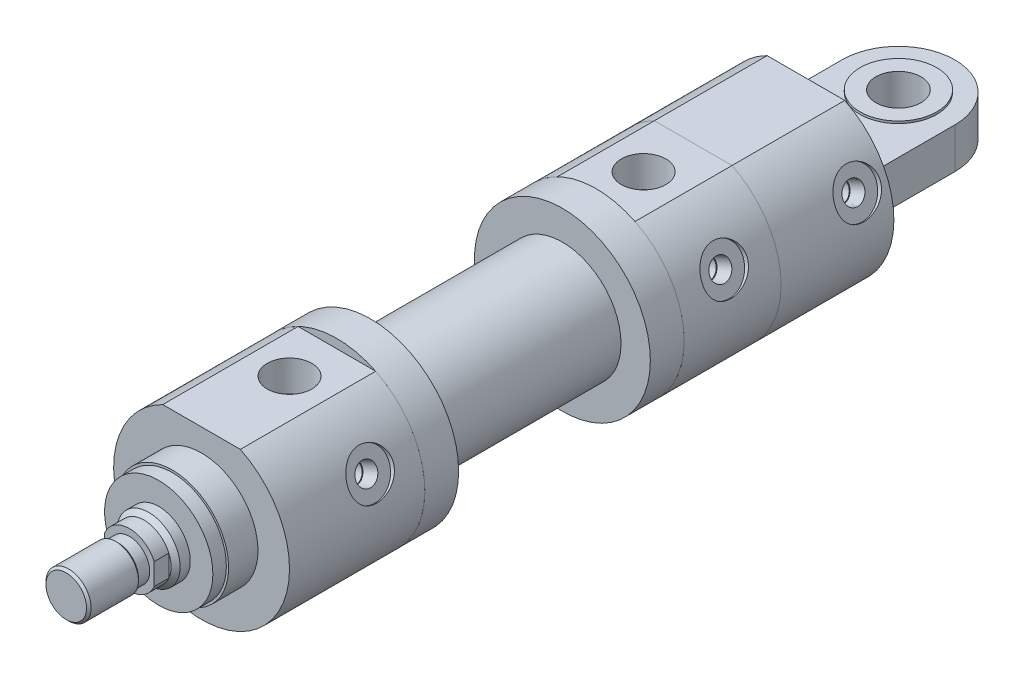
ISO-10303-21;
HEADER;
FILE_DESCRIPTION(('STEP AP214'),'2;1');
FILE_NAME('part.step','',(''),(''),'','','');
FILE_SCHEMA(('AUTOMOTIVE_DESIGN { 1 0 10303 214 1 1 1 1 }'));
ENDSEC;
DATA;
#1=APPLICATION_CONTEXT('core data for automotive mechanical design processes');
#2=APPLICATION_PROTOCOL_DEFINITION('international standard','automotive_design',2000,#1);
#3=PRODUCT_CONTEXT('',#1,'mechanical');
#4=PRODUCT('Part','Part','',(#3));
#5=PRODUCT_RELATED_PRODUCT_CATEGORY('part','',(#4));
#6=PRODUCT_DEFINITION_FORMATION('','',#4);
#7=PRODUCT_DEFINITION_CONTEXT('part definition',#1,'design');
#8=PRODUCT_DEFINITION('design','',#6,#7);
#9=PRODUCT_DEFINITION_SHAPE('','',#8);
#10=(LENGTH_UNIT() NAMED_UNIT(*) SI_UNIT(.MILLI.,.METRE.));
#11=(NAMED_UNIT(*) PLANE_ANGLE_UNIT() SI_UNIT($,.RADIAN.));
#12=(NAMED_UNIT(*) SI_UNIT($,.STERADIAN.) SOLID_ANGLE_UNIT());
#13=UNCERTAINTY_MEASURE_WITH_UNIT(LENGTH_MEASURE(1.E-05),#10,'distance_accuracy_value','');
#14=(GEOMETRIC_REPRESENTATION_CONTEXT(3) GLOBAL_UNCERTAINTY_ASSIGNED_CONTEXT((#13)) GLOBAL_UNIT_ASSIGNED_CONTEXT((#10,
#11,#12)) REPRESENTATION_CONTEXT('',''));
#15=CARTESIAN_POINT('',(0.,0.,0.));
#16=DIRECTION('',(0.,0.,1.));
#17=DIRECTION('',(1.,0.,0.));
#18=AXIS2_PLACEMENT_3D('',#15,#16,#17);
#19=CARTESIAN_POINT('',(0.,9.,-91.));
#20=DIRECTION('',(0.,-1.,0.));
#21=DIRECTION('',(0.,0.,-1.));
#22=AXIS2_PLACEMENT_3D('',#19,#20,#21);
#23=PLANE('',#22);
#24=DIRECTION('',(1.,0.,0.));
#25=VECTOR('',#24,1.);
#26=CARTESIAN_POINT('',(25.,9.,-50.));
#27=LINE('',#26,#25);
#28=CARTESIAN_POINT('',(-25.,9.,-50.));
#29=VERTEX_POINT('',#28);
#30=CARTESIAN_POINT('',(25.,9.,-50.));
#31=VERTEX_POINT('',#30);
#32=EDGE_CURVE('E143',#29,#31,#27,.T.);
#33=ORIENTED_EDGE('',*,*,#32,.T.);
#34=DIRECTION('',(0.,0.,-1.));
#35=VECTOR('',#34,1.);
#36=CARTESIAN_POINT('',(25.,9.,-91.));
#37=LINE('',#36,#35);
#38=CARTESIAN_POINT('',(25.,9.,-91.));
#39=VERTEX_POINT('',#38);
#40=EDGE_CURVE('E146',#31,#39,#37,.T.);
#41=ORIENTED_EDGE('',*,*,#40,.T.);
#42=CARTESIAN_POINT('',(0.,9.,-91.));
#43=DIRECTION('',(0.,1.,0.));
#44=DIRECTION('',(0.,0.,-1.));
#45=AXIS2_PLACEMENT_3D('',#42,#43,#44);
#46=CIRCLE('',#45,25.);
#47=CARTESIAN_POINT('',(-25.,9.,-91.));
#48=VERTEX_POINT('',#47);
#49=EDGE_CURVE('E148',#39,#48,#46,.T.);
#50=ORIENTED_EDGE('',*,*,#49,.T.);
#51=DIRECTION('',(0.,0.,1.));
#52=VECTOR('',#51,1.);
#53=CARTESIAN_POINT('',(-25.,9.,-50.));
#54=LINE('',#53,#52);
#55=EDGE_CURVE('E150',#48,#29,#54,.T.);
#56=ORIENTED_EDGE('',*,*,#55,.T.);
#57=EDGE_LOOP('',(#33,#41,#50,#56));
#58=FACE_BOUND('',#57,.T.);
#59=CARTESIAN_POINT('',(0.,9.,-91.));
#60=DIRECTION('',(0.,-1.,0.));
#61=DIRECTION('',(0.,0.,-1.));
#62=AXIS2_PLACEMENT_3D('',#59,#60,#61);
#63=CIRCLE('',#62,17.);
#64=CARTESIAN_POINT('',(0.,9.,-108.));
#65=VERTEX_POINT('',#64);
#66=EDGE_CURVE('E53',#65,#65,#63,.F.);
#67=ORIENTED_EDGE('',*,*,#66,.F.);
#68=EDGE_LOOP('',(#67));
#69=FACE_BOUND('',#68,.T.);
#70=ADVANCED_FACE('F41',(#58,#69),#23,.F.);
#71=CARTESIAN_POINT('',(0.,-9.,-91.));
#72=DIRECTION('',(0.,-1.,0.));
#73=DIRECTION('',(0.,0.,-1.));
#74=AXIS2_PLACEMENT_3D('',#71,#72,#73);
#75=PLANE('',#74);
#76=DIRECTION('',(1.,0.,0.));
#77=VECTOR('',#76,1.);
#78=CARTESIAN_POINT('',(25.,-9.,-50.));
#79=LINE('',#78,#77);
#80=CARTESIAN_POINT('',(-25.,-9.,-50.));
#81=VERTEX_POINT('',#80);
#82=CARTESIAN_POINT('',(25.,-9.,-50.));
#83=VERTEX_POINT('',#82);
#84=EDGE_CURVE('E60',#81,#83,#79,.T.);
#85=ORIENTED_EDGE('',*,*,#84,.F.);
#86=DIRECTION('',(0.,0.,1.));
#87=VECTOR('',#86,1.);
#88=CARTESIAN_POINT('',(-25.,-9.,-50.));
#89=LINE('',#88,#87);
#90=CARTESIAN_POINT('',(-25.,-9.,-91.));
#91=VERTEX_POINT('',#90);
#92=EDGE_CURVE('E141',#91,#81,#89,.T.);
#93=ORIENTED_EDGE('',*,*,#92,.F.);
#94=CARTESIAN_POINT('',(0.,-9.,-91.));
#95=DIRECTION('',(0.,1.,0.));
#96=DIRECTION('',(0.,0.,-1.));
#97=AXIS2_PLACEMENT_3D('',#94,#95,#96);
#98=CIRCLE('',#97,25.);
#99=CARTESIAN_POINT('',(25.,-9.,-91.));
#100=VERTEX_POINT('',#99);
#101=EDGE_CURVE('E139',#100,#91,#98,.T.);
#102=ORIENTED_EDGE('',*,*,#101,.F.);
#103=DIRECTION('',(0.,0.,-1.));
#104=VECTOR('',#103,1.);
#105=CARTESIAN_POINT('',(25.,-9.,-91.));
#106=LINE('',#105,#104);
#107=EDGE_CURVE('E137',#83,#100,#106,.T.);
#108=ORIENTED_EDGE('',*,*,#107,.F.);
#109=EDGE_LOOP('',(#85,#93,#102,#108));
#110=FACE_BOUND('',#109,.T.);
#111=CARTESIAN_POINT('',(0.,-9.,-91.));
#112=DIRECTION('',(0.,-1.,0.));
#113=DIRECTION('',(0.,0.,-1.));
#114=AXIS2_PLACEMENT_3D('',#111,#112,#113);
#115=CIRCLE('',#114,17.);
#116=CARTESIAN_POINT('',(0.,-9.,-108.));
#117=VERTEX_POINT('',#116);
#118=EDGE_CURVE('E132',#117,#117,#115,.F.);
#119=ORIENTED_EDGE('',*,*,#118,.T.);
#120=EDGE_LOOP('',(#119));
#121=FACE_BOUND('',#120,.T.);
#122=ADVANCED_FACE('F179',(#110,#121),#75,.T.);
#123=CARTESIAN_POINT('',(0.,0.,-50.));
#124=DIRECTION('',(0.,0.,-1.));
#125=DIRECTION('',(-1.,0.,0.));
#126=AXIS2_PLACEMENT_3D('',#123,#124,#125);
#127=PLANE('',#126);
#128=DIRECTION('',(-1.,0.,0.));
#129=VECTOR('',#128,1.);
#130=CARTESIAN_POINT('',(-39.,35.,-50.));
#131=LINE('',#130,#129);
#132=CARTESIAN_POINT('',(17.2046505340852,35.,-50.));
#133=VERTEX_POINT('',#132);
#134=CARTESIAN_POINT('',(-17.2046505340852,35.,-50.));
#135=VERTEX_POINT('',#134);
#136=EDGE_CURVE('E164',#133,#135,#131,.T.);
#137=ORIENTED_EDGE('',*,*,#136,.F.);
#138=CARTESIAN_POINT('',(0.,0.,-50.));
#139=DIRECTION('',(0.,0.,-1.));
#140=DIRECTION('',(-1.,0.,0.));
#141=AXIS2_PLACEMENT_3D('',#138,#139,#140);
#142=CIRCLE('',#141,39.);
#143=EDGE_CURVE('E173',#133,#135,#142,.T.);
#144=ORIENTED_EDGE('',*,*,#143,.T.);
#145=EDGE_LOOP('',(#137,#144));
#146=FACE_BOUND('',#145,.T.);
#147=ORIENTED_EDGE('',*,*,#84,.T.);
#148=DIRECTION('',(0.,-1.,0.));
#149=VECTOR('',#148,1.);
#150=CARTESIAN_POINT('',(25.,9.,-50.));
#151=LINE('',#150,#149);
#152=EDGE_CURVE('E161',#31,#83,#151,.T.);
#153=ORIENTED_EDGE('',*,*,#152,.F.);
#154=ORIENTED_EDGE('',*,*,#32,.F.);
#155=DIRECTION('',(0.,-1.,0.));
#156=VECTOR('',#155,1.);
#157=CARTESIAN_POINT('',(-25.,9.,-50.));
#158=LINE('',#157,#156);
#159=EDGE_CURVE('E152',#29,#81,#158,.T.);
#160=ORIENTED_EDGE('',*,*,#159,.T.);
#161=EDGE_LOOP('',(#147,#153,#154,#160));
#162=FACE_BOUND('',#161,.T.);
#163=ADVANCED_FACE('F218',(#146,#162),#127,.T.);
#164=CARTESIAN_POINT('',(0.,0.,-50.));
#165=DIRECTION('',(0.,0.,1.));
#166=DIRECTION('',(1.,0.,0.));
#167=AXIS2_PLACEMENT_3D('',#164,#165,#166);
#168=CYLINDRICAL_SURFACE('',#167,39.);
#169=CARTESIAN_POINT('',(30.7921811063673,23.9341091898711,-37.));
#170=CARTESIAN_POINT('',(30.7921821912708,23.9341084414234,-37.2758740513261));
#171=CARTESIAN_POINT('',(30.7994407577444,23.9247782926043,-37.5517699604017));
#172=CARTESIAN_POINT('',(30.8283541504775,23.887509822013,-38.1015592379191));
#173=CARTESIAN_POINT('',(30.8500105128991,23.8595695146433,-38.3754523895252));
#174=CARTESIAN_POINT('',(30.9073644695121,23.7852270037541,-38.9193652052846));
#175=CARTESIAN_POINT('',(30.9430686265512,23.7388161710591,-39.1893829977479));
#176=CARTESIAN_POINT('',(31.0279243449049,23.6277968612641,-39.7235011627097));
#177=CARTESIAN_POINT('',(31.0770762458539,23.5631879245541,-39.9876013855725));
#178=CARTESIAN_POINT('',(31.1879569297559,23.416229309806,-40.5076984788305));
#179=CARTESIAN_POINT('',(31.2496682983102,23.3339041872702,-40.7637060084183));
#180=CARTESIAN_POINT('',(31.3847544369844,23.1518902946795,-41.2662933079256));
#181=CARTESIAN_POINT('',(31.4581292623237,23.0522014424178,-41.5128730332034));
#182=CARTESIAN_POINT('',(31.6154433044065,22.8359718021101,-41.9949739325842));
#183=CARTESIAN_POINT('',(31.6993809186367,22.7194335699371,-42.2304967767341));
#184=CARTESIAN_POINT('',(31.8766739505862,22.470003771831,-42.6891207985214));
#185=CARTESIAN_POINT('',(31.97003274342,22.3371063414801,-42.9122174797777));
#186=CARTESIAN_POINT('',(32.1668811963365,22.0527154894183,-43.3489442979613));
#187=CARTESIAN_POINT('',(32.2705392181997,21.9008968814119,-43.562286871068));
#188=CARTESIAN_POINT('',(32.4849811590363,21.5815430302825,-43.9732120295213));
#189=CARTESIAN_POINT('',(32.5957683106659,21.414000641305,-44.1707873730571));
#190=CARTESIAN_POINT('',(32.8230107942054,21.064032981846,-44.5487968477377));
#191=CARTESIAN_POINT('',(32.9394666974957,20.8816062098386,-44.7292292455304));
#192=CARTESIAN_POINT('',(33.1765381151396,20.5028583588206,-45.0716379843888));
#193=CARTESIAN_POINT('',(33.2971517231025,20.3065436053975,-45.2336226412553));
#194=CARTESIAN_POINT('',(33.5430039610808,19.8978541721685,-45.5404171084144));
#195=CARTESIAN_POINT('',(33.6682850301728,19.6852806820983,-45.6849283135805));
#196=CARTESIAN_POINT('',(33.9201579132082,19.2480261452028,-45.9527194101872));
#197=CARTESIAN_POINT('',(34.0467491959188,19.0233498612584,-46.07600757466));
#198=CARTESIAN_POINT('',(34.29984607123,18.5631226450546,-46.3004563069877));
#199=CARTESIAN_POINT('',(34.4263516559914,18.3275708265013,-46.4016150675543));
#200=CARTESIAN_POINT('',(34.6778656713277,17.8471046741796,-46.5809498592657));
#201=CARTESIAN_POINT('',(34.8028741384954,17.6021905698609,-46.6591264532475));
#202=CARTESIAN_POINT('',(35.0474491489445,17.1099452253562,-46.7904106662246));
#203=CARTESIAN_POINT('',(35.1670748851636,16.8627760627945,-46.8440159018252));
#204=CARTESIAN_POINT('',(35.4024986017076,16.3627457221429,-46.9281043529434));
#205=CARTESIAN_POINT('',(35.5182966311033,16.1098846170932,-46.9585878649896));
#206=CARTESIAN_POINT('',(35.7450390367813,15.6003186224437,-46.99616272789));
#207=CARTESIAN_POINT('',(35.8559840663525,15.3436142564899,-47.0032572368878));
#208=CARTESIAN_POINT('',(36.0721705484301,14.8282364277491,-46.9939996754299));
#209=CARTESIAN_POINT('',(36.1774120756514,14.5695629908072,-46.9776479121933));
#210=CARTESIAN_POINT('',(36.3791005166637,14.0582647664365,-46.922299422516));
#211=CARTESIAN_POINT('',(36.4756954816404,13.8056398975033,-46.8838408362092));
#212=CARTESIAN_POINT('',(36.6622735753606,13.3022460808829,-46.7850217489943));
#213=CARTESIAN_POINT('',(36.7522568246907,13.0514770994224,-46.7246616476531));
#214=CARTESIAN_POINT('',(36.9252571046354,12.5536774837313,-46.5825390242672));
#215=CARTESIAN_POINT('',(37.0082751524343,12.3066463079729,-46.500779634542));
#216=CARTESIAN_POINT('',(37.1671992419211,11.8180090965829,-46.3164591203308));
#217=CARTESIAN_POINT('',(37.2431026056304,11.5764051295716,-46.2138902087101));
#218=CARTESIAN_POINT('',(37.3883762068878,11.0983027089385,-45.9877049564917));
#219=CARTESIAN_POINT('',(37.4576802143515,10.8618713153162,-45.863904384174));
#220=CARTESIAN_POINT('',(37.5890420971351,10.3981726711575,-45.5968147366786));
#221=CARTESIAN_POINT('',(37.6510996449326,10.1709058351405,-45.453524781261));
#222=CARTESIAN_POINT('',(37.768164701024,9.72719873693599,-45.1484339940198));
#223=CARTESIAN_POINT('',(37.8231712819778,9.51075990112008,-44.9866307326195));
#224=CARTESIAN_POINT('',(37.9264078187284,9.09034936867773,-44.6456023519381));
#225=CARTESIAN_POINT('',(37.9746376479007,8.88637790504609,-44.4663769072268));
#226=CARTESIAN_POINT('',(38.065954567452,8.48683046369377,-44.0863123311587));
#227=CARTESIAN_POINT('',(38.1088560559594,8.29165907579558,-43.8850029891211));
#228=CARTESIAN_POINT('',(38.1882956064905,7.91774091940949,-43.4665085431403));
#229=CARTESIAN_POINT('',(38.2248337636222,7.73899390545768,-43.2493236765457));
#230=CARTESIAN_POINT('',(38.2920222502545,7.39939259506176,-42.8004357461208));
#231=CARTESIAN_POINT('',(38.3226710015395,7.23854309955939,-42.5687288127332));
#232=CARTESIAN_POINT('',(38.3785306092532,6.93628217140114,-42.0924667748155));
#233=CARTESIAN_POINT('',(38.4037435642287,6.79486324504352,-41.8479166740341));
#234=CARTESIAN_POINT('',(38.4493315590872,6.53198352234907,-41.3461293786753));
#235=CARTESIAN_POINT('',(38.4696789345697,6.4106380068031,-41.0888292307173));
#236=CARTESIAN_POINT('',(38.5057848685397,6.19007515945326,-40.5645942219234));
#237=CARTESIAN_POINT('',(38.5215433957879,6.09085797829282,-40.297659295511));
#238=CARTESIAN_POINT('',(38.5488446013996,5.91561085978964,-39.7561232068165));
#239=CARTESIAN_POINT('',(38.5603880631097,5.8395766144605,-39.4815234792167));
#240=CARTESIAN_POINT('',(38.5795656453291,5.7115073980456,-38.9266501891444));
#241=CARTESIAN_POINT('',(38.5871998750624,5.65947175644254,-38.646376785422));
#242=CARTESIAN_POINT('',(38.5986132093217,5.58109138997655,-38.0901184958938));
#243=CARTESIAN_POINT('',(38.6024933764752,5.55407406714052,-37.8142303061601));
#244=CARTESIAN_POINT('',(38.6068689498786,5.52357772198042,-37.2611308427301));
#245=CARTESIAN_POINT('',(38.6073644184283,5.5200982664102,-36.9839195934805));
#246=CARTESIAN_POINT('',(38.6049848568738,5.53671499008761,-36.4302456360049));
#247=CARTESIAN_POINT('',(38.6021101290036,5.55680905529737,-36.1537828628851));
#248=CARTESIAN_POINT('',(38.5929102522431,5.62034748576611,-35.6036141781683));
#249=CARTESIAN_POINT('',(38.5865851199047,5.6637917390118,-35.3299082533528));
#250=CARTESIAN_POINT('',(38.570457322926,5.77258892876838,-34.7920298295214));
#251=CARTESIAN_POINT('',(38.5607179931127,5.83754173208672,-34.527774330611));
#252=CARTESIAN_POINT('',(38.5375014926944,5.98889273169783,-34.0055464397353));
#253=CARTESIAN_POINT('',(38.5240229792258,6.07529863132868,-33.7475763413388));
#254=CARTESIAN_POINT('',(38.4930266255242,6.26869060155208,-33.2397577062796));
#255=CARTESIAN_POINT('',(38.4755092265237,6.37567442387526,-32.9899082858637));
#256=CARTESIAN_POINT('',(38.4360767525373,6.60923767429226,-32.4998953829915));
#257=CARTESIAN_POINT('',(38.4141614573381,6.73581808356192,-32.2597323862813));
#258=CARTESIAN_POINT('',(38.3650410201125,7.01023860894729,-31.7857914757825));
#259=CARTESIAN_POINT('',(38.3377366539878,7.15846132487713,-31.5522453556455));
#260=CARTESIAN_POINT('',(38.277697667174,7.47284838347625,-31.0982995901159));
#261=CARTESIAN_POINT('',(38.2449629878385,7.63901291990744,-30.8779000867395));
#262=CARTESIAN_POINT('',(38.1736133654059,7.98792498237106,-30.4515998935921));
#263=CARTESIAN_POINT('',(38.1349974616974,8.17067521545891,-30.2457015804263));
#264=CARTESIAN_POINT('',(38.0514625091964,8.55126597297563,-29.8497465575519));
#265=CARTESIAN_POINT('',(38.0065435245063,8.74910634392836,-29.6596896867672));
#266=CARTESIAN_POINT('',(37.908720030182,9.16381609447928,-29.2917786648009));
#267=CARTESIAN_POINT('',(37.8556342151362,9.38105268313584,-29.1143862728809));
#268=CARTESIAN_POINT('',(37.7420685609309,9.8279903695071,-28.7788832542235));
#269=CARTESIAN_POINT('',(37.6815914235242,10.0576868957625,-28.620765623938));
#270=CARTESIAN_POINT('',(37.5529507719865,10.5278337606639,-28.3248592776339));
#271=CARTESIAN_POINT('',(37.4847860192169,10.7682858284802,-28.1870738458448));
#272=CARTESIAN_POINT('',(37.3406289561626,11.2580001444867,-27.9329143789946));
#273=CARTESIAN_POINT('',(37.2646367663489,11.507262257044,-27.8165400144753));
#274=CARTESIAN_POINT('',(37.1054105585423,12.0107322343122,-27.6069160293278));
#275=CARTESIAN_POINT('',(37.0222346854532,12.2648894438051,-27.5135006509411));
#276=CARTESIAN_POINT('',(36.8483097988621,12.7779270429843,-27.3494510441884));
#277=CARTESIAN_POINT('',(36.7575608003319,13.0368074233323,-27.2788167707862));
#278=CARTESIAN_POINT('',(36.5688261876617,13.5571951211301,-27.1609477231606));
#279=CARTESIAN_POINT('',(36.4708418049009,13.8187019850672,-27.1137089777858));
#280=CARTESIAN_POINT('',(36.2681241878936,14.3423140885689,-27.0430335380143));
#281=CARTESIAN_POINT('',(36.1633911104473,14.6044193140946,-27.0195962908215));
#282=CARTESIAN_POINT('',(35.9509248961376,15.1197373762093,-26.9970585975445));
#283=CARTESIAN_POINT('',(35.8433617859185,15.3729911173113,-26.9972849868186));
#284=CARTESIAN_POINT('',(35.6232903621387,15.8762909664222,-27.0203993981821));
#285=CARTESIAN_POINT('',(35.5107821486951,16.1263371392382,-27.0432869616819));
#286=CARTESIAN_POINT('',(35.2817449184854,16.6214583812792,-27.111526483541));
#287=CARTESIAN_POINT('',(35.165216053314,16.8665336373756,-27.1568775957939));
#288=CARTESIAN_POINT('',(34.9291753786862,17.3500747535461,-27.2696637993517));
#289=CARTESIAN_POINT('',(34.8096635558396,17.5885405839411,-27.3370989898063));
#290=CARTESIAN_POINT('',(34.5695422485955,18.0558952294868,-27.4930229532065));
#291=CARTESIAN_POINT('',(34.4489440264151,18.2848339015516,-27.5813797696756));
#292=CARTESIAN_POINT('',(34.2070867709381,18.7333972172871,-27.7787165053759));
#293=CARTESIAN_POINT('',(34.0858275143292,18.9530184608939,-27.8877038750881));
#294=CARTESIAN_POINT('',(33.8439599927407,19.3816130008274,-28.1254629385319));
#295=CARTESIAN_POINT('',(33.7233516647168,19.5905873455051,-28.2542326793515));
#296=CARTESIAN_POINT('',(33.4840625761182,19.9968282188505,-28.5306612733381));
#297=CARTESIAN_POINT('',(33.3653819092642,20.1940941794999,-28.6783210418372));
#298=CARTESIAN_POINT('',(33.1283406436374,20.5807129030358,-28.9954490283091));
#299=CARTESIAN_POINT('',(33.0100621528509,20.7697447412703,-29.1653700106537));
#300=CARTESIAN_POINT('',(32.7783405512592,21.1335495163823,-29.5228575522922));
#301=CARTESIAN_POINT('',(32.6648975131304,21.3083222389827,-29.7104243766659));
#302=CARTESIAN_POINT('',(32.4442357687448,21.6428216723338,-30.1020220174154));
#303=CARTESIAN_POINT('',(32.3370186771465,21.8025444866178,-30.306057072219));
#304=CARTESIAN_POINT('',(32.130238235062,22.1061424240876,-30.729229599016));
#305=CARTESIAN_POINT('',(32.0306747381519,22.2500178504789,-30.9483667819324));
#306=CARTESIAN_POINT('',(31.838635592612,22.523983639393,-31.4049033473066));
#307=CARTESIAN_POINT('',(31.7463431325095,22.6537379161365,-31.6425816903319));
#308=CARTESIAN_POINT('',(31.5725309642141,22.8953584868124,-32.1305161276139));
#309=CARTESIAN_POINT('',(31.4910073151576,23.00723132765,-32.3807675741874));
#310=CARTESIAN_POINT('',(31.3399927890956,23.2125201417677,-32.8921038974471));
#311=CARTESIAN_POINT('',(31.2704969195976,23.3059437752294,-33.1531842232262));
#312=CARTESIAN_POINT('',(31.1446368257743,23.4738710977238,-33.6844148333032));
#313=CARTESIAN_POINT('',(31.088270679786,23.5483775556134,-33.9545637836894));
#314=CARTESIAN_POINT('',(30.9984798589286,23.6664043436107,-34.452785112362));
#315=CARTESIAN_POINT('',(30.9627531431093,23.7130863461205,-34.6797023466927));
#316=CARTESIAN_POINT('',(30.9011929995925,23.7932518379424,-35.1371759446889));
#317=CARTESIAN_POINT('',(30.8753588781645,23.8267362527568,-35.367732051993));
#318=CARTESIAN_POINT('',(30.8338951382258,23.8803698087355,-35.8313214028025));
#319=CARTESIAN_POINT('',(30.8182663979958,23.9005178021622,-36.0643548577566));
#320=CARTESIAN_POINT('',(30.7974103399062,23.9273859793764,-36.5315871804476));
#321=CARTESIAN_POINT('',(30.7921801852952,23.9341098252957,-36.7657857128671));
#322=CARTESIAN_POINT('',(30.7921811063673,23.9341091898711,-37.));
#323=B_SPLINE_CURVE_WITH_KNOTS('',3,(#169,#170,#171,#172,#173,#174,#175,#176,#177,#178,#179,
#180,#181,#182,#183,#184,#185,#186,#187,#188,#189,#190,#191,#192,#193,#194,#195,#196,#197,#198,
#199,#200,#201,#202,#203,#204,#205,#206,#207,#208,#209,#210,#211,#212,#213,#214,#215,#216,#217,
#218,#219,#220,#221,#222,#223,#224,#225,#226,#227,#228,#229,#230,#231,#232,#233,#234,#235,#236,
#237,#238,#239,#240,#241,#242,#243,#244,#245,#246,#247,#248,#249,#250,#251,#252,#253,#254,#255,
#256,#257,#258,#259,#260,#261,#262,#263,#264,#265,#266,#267,#268,#269,#270,#271,#272,#273,#274,
#275,#276,#277,#278,#279,#280,#281,#282,#283,#284,#285,#286,#287,#288,#289,#290,#291,#292,#293,
#294,#295,#296,#297,#298,#299,#300,#301,#302,#303,#304,#305,#306,#307,#308,#309,#310,#311,#312,
#313,#314,#315,#316,#317,#318,#319,#320,#321,#322),.UNSPECIFIED.,.T.,.F.,(4,2,2,2,2,2,2,2,2,2,2,
2,2,2,2,2,2,2,2,2,2,2,2,2,2,2,2,2,2,2,2,2,2,2,2,2,2,2,2,2,2,2,2,2,2,2,2,2,2,2,2,2,2,2,2,2,2,2,2,
2,2,2,2,2,2,2,2,2,2,2,2,2,2,2,2,2,4),(0.,0.827407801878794,1.65490389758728,2.48278704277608,
3.31069109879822,4.13745494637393,4.96422270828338,5.79086518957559,6.6178048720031,
7.46168541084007,8.30595133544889,9.15030253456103,9.99427160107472,10.8510736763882,
11.7075409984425,12.5640782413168,13.4205945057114,14.2589018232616,15.0971983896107,
15.9353817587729,16.7735541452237,17.5921385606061,18.4107080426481,19.2291577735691,
20.0479143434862,20.8741725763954,21.7004681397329,22.5268722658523,23.353291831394,
24.2032496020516,25.0531946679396,25.9033671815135,26.7532108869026,27.6077774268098,
28.4623497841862,29.3167632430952,30.1711528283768,31.0018426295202,31.8325171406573,
32.6631171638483,33.4937132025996,34.309652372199,35.1258849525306,35.9420284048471,
36.7582127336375,37.5911273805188,38.4240510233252,39.2571108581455,40.0901622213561,
40.9454730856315,41.8004722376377,42.6556093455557,43.5107332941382,44.359489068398,
45.2082431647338,46.056853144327,46.9054434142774,47.7299004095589,48.5543407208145,
49.3787499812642,50.2031629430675,51.0225085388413,51.8421505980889,52.6617117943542,
53.4813127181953,54.3213946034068,55.1614891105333,56.00180052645,56.8420958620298,
57.6993188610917,58.5562272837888,59.412779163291,60.2692055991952,60.9718470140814,
61.6744391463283,62.3770917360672,63.0795526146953),.UNSPECIFIED.);
#324=CARTESIAN_POINT('',(30.7921811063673,23.9341091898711,-37.));
#325=VERTEX_POINT('',#324);
#326=EDGE_CURVE('E12',#325,#325,#323,.T.);
#327=ORIENTED_EDGE('',*,*,#326,.T.);
#328=EDGE_LOOP('',(#327));
#329=FACE_BOUND('',#328,.T.);
#330=ORIENTED_EDGE('',*,*,#143,.F.);
#331=DIRECTION('',(0.,0.,1.));
#332=VECTOR('',#331,1.);
#333=CARTESIAN_POINT('',(17.2046505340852,35.,-50.));
#334=LINE('',#333,#332);
#335=CARTESIAN_POINT('',(17.2046505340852,35.,0.));
#336=VERTEX_POINT('',#335);
#337=EDGE_CURVE('E167',#133,#336,#334,.T.);
#338=ORIENTED_EDGE('',*,*,#337,.T.);
#339=CARTESIAN_POINT('',(0.,0.,0.));
#340=DIRECTION('',(0.,0.,-1.));
#341=DIRECTION('',(-1.,0.,0.));
#342=AXIS2_PLACEMENT_3D('',#339,#340,#341);
#343=CIRCLE('',#342,39.);
#344=CARTESIAN_POINT('',(-17.2046505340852,35.,0.));
#345=VERTEX_POINT('',#344);
#346=EDGE_CURVE('E170',#336,#345,#343,.T.);
#347=ORIENTED_EDGE('',*,*,#346,.T.);
#348=DIRECTION('',(0.,0.,1.));
#349=VECTOR('',#348,1.);
#350=CARTESIAN_POINT('',(-17.2046505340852,35.,-50.));
#351=LINE('',#350,#349);
#352=EDGE_CURVE('E68',#345,#135,#351,.F.);
#353=ORIENTED_EDGE('',*,*,#352,.T.);
#354=EDGE_LOOP('',(#330,#338,#347,#353));
#355=FACE_BOUND('',#354,.T.);
#356=ADVANCED_FACE('F43',(#329,#355),#168,.T.);
#357=CARTESIAN_POINT('',(0.,0.,0.));
#358=DIRECTION('',(0.,0.,-1.));
#359=DIRECTION('',(-1.,0.,0.));
#360=AXIS2_PLACEMENT_3D('',#357,#358,#359);
#361=PLANE('',#360);
#362=ORIENTED_EDGE('',*,*,#346,.F.);
#363=DIRECTION('',(-1.,0.,0.));
#364=VECTOR('',#363,1.);
#365=CARTESIAN_POINT('',(0.,35.,0.));
#366=LINE('',#365,#364);
#367=EDGE_CURVE('E135',#336,#345,#366,.T.);
#368=ORIENTED_EDGE('',*,*,#367,.T.);
#369=EDGE_LOOP('',(#362,#368));
#370=FACE_BOUND('',#369,.T.);
#371=ADVANCED_FACE('F236',(#370),#361,.F.);
#372=CARTESIAN_POINT('',(-39.,35.,-50.));
#373=DIRECTION('',(0.,-1.,0.));
#374=DIRECTION('',(0.,0.,-1.));
#375=AXIS2_PLACEMENT_3D('',#372,#373,#374);
#376=PLANE('',#375);
#377=ORIENTED_EDGE('',*,*,#136,.T.);
#378=ORIENTED_EDGE('',*,*,#352,.F.);
#379=ORIENTED_EDGE('',*,*,#367,.F.);
#380=ORIENTED_EDGE('',*,*,#337,.F.);
#381=EDGE_LOOP('',(#377,#378,#379,#380));
#382=FACE_BOUND('',#381,.T.);
#383=ADVANCED_FACE('F232',(#382),#376,.F.);
#384=CARTESIAN_POINT('',(25.,9.,-91.));
#385=DIRECTION('',(-1.,0.,0.));
#386=DIRECTION('',(0.,0.,1.));
#387=AXIS2_PLACEMENT_3D('',#384,#385,#386);
#388=PLANE('',#387);
#389=ORIENTED_EDGE('',*,*,#107,.T.);
#390=DIRECTION('',(0.,-1.,0.));
#391=VECTOR('',#390,1.);
#392=CARTESIAN_POINT('',(25.,9.,-91.));
#393=LINE('',#392,#391);
#394=EDGE_CURVE('E158',#39,#100,#393,.T.);
#395=ORIENTED_EDGE('',*,*,#394,.F.);
#396=ORIENTED_EDGE('',*,*,#40,.F.);
#397=ORIENTED_EDGE('',*,*,#152,.T.);
#398=EDGE_LOOP('',(#389,#395,#396,#397));
#399=FACE_BOUND('',#398,.T.);
#400=ADVANCED_FACE('F228',(#399),#388,.F.);
#401=CARTESIAN_POINT('',(0.,9.,-91.));
#402=DIRECTION('',(0.,-1.,0.));
#403=DIRECTION('',(0.,0.,-1.));
#404=AXIS2_PLACEMENT_3D('',#401,#402,#403);
#405=CYLINDRICAL_SURFACE('',#404,25.);
#406=ORIENTED_EDGE('',*,*,#101,.T.);
#407=DIRECTION('',(0.,-1.,0.));
#408=VECTOR('',#407,1.);
#409=CARTESIAN_POINT('',(-25.,9.,-91.));
#410=LINE('',#409,#408);
#411=EDGE_CURVE('E155',#48,#91,#410,.T.);
#412=ORIENTED_EDGE('',*,*,#411,.F.);
#413=ORIENTED_EDGE('',*,*,#49,.F.);
#414=ORIENTED_EDGE('',*,*,#394,.T.);
#415=EDGE_LOOP('',(#406,#412,#413,#414));
#416=FACE_BOUND('',#415,.T.);
#417=ADVANCED_FACE('F224',(#416),#405,.T.);
#418=CARTESIAN_POINT('',(-25.,9.,-50.));
#419=DIRECTION('',(1.,0.,0.));
#420=DIRECTION('',(0.,0.,-1.));
#421=AXIS2_PLACEMENT_3D('',#418,#419,#420);
#422=PLANE('',#421);
#423=ORIENTED_EDGE('',*,*,#92,.T.);
#424=ORIENTED_EDGE('',*,*,#159,.F.);
#425=ORIENTED_EDGE('',*,*,#55,.F.);
#426=ORIENTED_EDGE('',*,*,#411,.T.);
#427=EDGE_LOOP('',(#423,#424,#425,#426));
#428=FACE_BOUND('',#427,.T.);
#429=ADVANCED_FACE('F185',(#428),#422,.F.);
#430=CARTESIAN_POINT('',(0.,10.,-91.));
#431=DIRECTION('',(0.,-1.,0.));
#432=DIRECTION('',(0.,0.,-1.));
#433=AXIS2_PLACEMENT_3D('',#430,#431,#432);
#434=CYLINDRICAL_SURFACE('',#433,17.);
#435=ORIENTED_EDGE('',*,*,#118,.F.);
#436=EDGE_LOOP('',(#435));
#437=FACE_BOUND('',#436,.T.);
#438=CARTESIAN_POINT('',(0.,-10.,-91.));
#439=DIRECTION('',(0.,1.,0.));
#440=DIRECTION('',(0.,0.,1.));
#441=AXIS2_PLACEMENT_3D('',#438,#439,#440);
#442=CIRCLE('',#441,17.);
#443=CARTESIAN_POINT('',(0.,-10.,-74.));
#444=VERTEX_POINT('',#443);
#445=EDGE_CURVE('E126',#444,#444,#442,.T.);
#446=ORIENTED_EDGE('',*,*,#445,.T.);
#447=EDGE_LOOP('',(#446));
#448=FACE_BOUND('',#447,.T.);
#449=ADVANCED_FACE('F181',(#437,#448),#434,.T.);
#450=CARTESIAN_POINT('',(0.,-10.,-91.));
#451=DIRECTION('',(0.,1.,0.));
#452=DIRECTION('',(0.,0.,1.));
#453=AXIS2_PLACEMENT_3D('',#450,#451,#452);
#454=PLANE('',#453);
#455=ORIENTED_EDGE('',*,*,#445,.F.);
#456=EDGE_LOOP('',(#455));
#457=FACE_BOUND('',#456,.T.);
#458=CARTESIAN_POINT('',(0.,-10.,-91.));
#459=DIRECTION('',(0.,1.,0.));
#460=DIRECTION('',(0.,0.,1.));
#461=AXIS2_PLACEMENT_3D('',#458,#459,#460);
#462=CIRCLE('',#461,9.99999999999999);
#463=CARTESIAN_POINT('',(0.,-10.,-81.));
#464=VERTEX_POINT('',#463);
#465=EDGE_CURVE('E114',#464,#464,#462,.T.);
#466=ORIENTED_EDGE('',*,*,#465,.T.);
#467=EDGE_LOOP('',(#466));
#468=FACE_BOUND('',#467,.T.);
#469=ADVANCED_FACE('F184',(#457,#468),#454,.F.);
#470=CARTESIAN_POINT('',(0.,9.,-91.));
#471=DIRECTION('',(0.,-1.,0.));
#472=DIRECTION('',(0.,0.,-1.));
#473=AXIS2_PLACEMENT_3D('',#470,#471,#472);
#474=CYLINDRICAL_SURFACE('',#473,9.99999999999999);
#475=ORIENTED_EDGE('',*,*,#465,.F.);
#476=EDGE_LOOP('',(#475));
#477=FACE_BOUND('',#476,.T.);
#478=CARTESIAN_POINT('',(0.,10.,-91.));
#479=DIRECTION('',(0.,1.,0.));
#480=DIRECTION('',(0.,0.,1.));
#481=AXIS2_PLACEMENT_3D('',#478,#479,#480);
#482=CIRCLE('',#481,9.99999999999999);
#483=CARTESIAN_POINT('',(0.,10.,-81.));
#484=VERTEX_POINT('',#483);
#485=EDGE_CURVE('E123',#484,#484,#482,.T.);
#486=ORIENTED_EDGE('',*,*,#485,.T.);
#487=EDGE_LOOP('',(#486));
#488=FACE_BOUND('',#487,.T.);
#489=ADVANCED_FACE('F192',(#477,#488),#474,.F.);
#490=CARTESIAN_POINT('',(0.,10.,-91.));
#491=DIRECTION('',(0.,1.,0.));
#492=DIRECTION('',(0.,0.,1.));
#493=AXIS2_PLACEMENT_3D('',#490,#491,#492);
#494=CIRCLE('',#493,17.);
#495=CARTESIAN_POINT('',(0.,10.,-74.));
#496=VERTEX_POINT('',#495);
#497=EDGE_CURVE('E129',#496,#496,#494,.T.);
#498=ORIENTED_EDGE('',*,*,#497,.F.);
#499=EDGE_LOOP('',(#498));
#500=FACE_BOUND('',#499,.T.);
#501=ORIENTED_EDGE('',*,*,#66,.T.);
#502=EDGE_LOOP('',(#501));
#503=FACE_BOUND('',#502,.T.);
#504=ADVANCED_FACE('F187',(#500,#503),#434,.T.);
#505=CARTESIAN_POINT('',(0.,10.,-91.));
#506=DIRECTION('',(0.,1.,0.));
#507=DIRECTION('',(0.,0.,1.));
#508=AXIS2_PLACEMENT_3D('',#505,#506,#507);
#509=PLANE('',#508);
#510=ORIENTED_EDGE('',*,*,#497,.T.);
#511=EDGE_LOOP('',(#510));
#512=FACE_BOUND('',#511,.T.);
#513=ORIENTED_EDGE('',*,*,#485,.F.);
#514=EDGE_LOOP('',(#513));
#515=FACE_BOUND('',#514,.T.);
#516=ADVANCED_FACE('F201',(#512,#515),#509,.T.);
#517=CARTESIAN_POINT('',(34.0586795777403,14.4570517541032,-37.));
#518=DIRECTION('',(0.92050485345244,0.390731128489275,0.));
#519=DIRECTION('',(-0.390731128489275,0.92050485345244,0.));
#520=AXIS2_PLACEMENT_3D('',#517,#518,#519);
#521=CYLINDRICAL_SURFACE('',#520,10.);
#522=CARTESIAN_POINT('',(34.0586795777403,14.4570517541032,-37.));
#523=DIRECTION('',(0.92050485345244,0.390731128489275,0.));
#524=DIRECTION('',(-0.390731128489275,0.92050485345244,0.));
#525=AXIS2_PLACEMENT_3D('',#522,#523,#524);
#526=CIRCLE('',#525,10.);
#527=CARTESIAN_POINT('',(30.1513682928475,23.6621002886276,-37.));
#528=VERTEX_POINT('',#527);
#529=EDGE_CURVE('E110',#528,#528,#526,.T.);
#530=ORIENTED_EDGE('',*,*,#529,.F.);
#531=EDGE_LOOP('',(#530));
#532=FACE_BOUND('',#531,.T.);
#533=ORIENTED_EDGE('',*,*,#326,.F.);
#534=EDGE_LOOP('',(#533));
#535=FACE_BOUND('',#534,.T.);
#536=ADVANCED_FACE('F203',(#532,#535),#521,.F.);
#537=CARTESIAN_POINT('',(34.0586795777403,14.4570517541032,-37.));
#538=DIRECTION('',(0.92050485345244,0.390731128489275,0.));
#539=DIRECTION('',(-0.390731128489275,0.92050485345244,0.));
#540=AXIS2_PLACEMENT_3D('',#537,#538,#539);
#541=PLANE('',#540);
#542=CARTESIAN_POINT('',(34.0586795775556,14.4570517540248,-37.));
#543=DIRECTION('',(0.92050485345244,0.390731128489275,0.));
#544=DIRECTION('',(-0.390731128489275,0.92050485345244,0.));
#545=AXIS2_PLACEMENT_3D('',#542,#543,#544);
#546=CIRCLE('',#545,4.74472);
#547=CARTESIAN_POINT('',(32.20476977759,18.8245895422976,-37.));
#548=VERTEX_POINT('',#547);
#549=EDGE_CURVE('E362',#548,#548,#546,.T.);
#550=ORIENTED_EDGE('',*,*,#549,.F.);
#551=EDGE_LOOP('',(#550));
#552=FACE_BOUND('',#551,.T.);
#553=ORIENTED_EDGE('',*,*,#529,.T.);
#554=EDGE_LOOP('',(#553));
#555=FACE_BOUND('',#554,.T.);
#556=ADVANCED_FACE('F104',(#552,#555),#541,.T.);
#557=CARTESIAN_POINT('',(23.3596516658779,9.91558384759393,-37.));
#558=DIRECTION('',(0.92050485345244,0.390731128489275,0.));
#559=DIRECTION('',(-0.390731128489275,0.92050485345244,0.));
#560=AXIS2_PLACEMENT_3D('',#557,#558,#559);
#561=CONICAL_SURFACE('',#560,4.2164,1.02974425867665);
#562=CARTESIAN_POINT('',(21.0275814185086,8.92567875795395,-37.));
#563=VERTEX_POINT('',#562);
#564=VERTEX_LOOP('',#563);
#565=FACE_BOUND('',#564,.T.);
#566=CARTESIAN_POINT('',(23.3596516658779,9.91558384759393,-37.));
#567=DIRECTION('',(0.92050485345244,0.390731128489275,0.));
#568=DIRECTION('',(-0.390731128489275,0.92050485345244,0.));
#569=AXIS2_PLACEMENT_3D('',#566,#567,#568);
#570=CIRCLE('',#569,4.2164);
#571=CARTESIAN_POINT('',(21.7121729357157,13.7968005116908,-37.));
#572=VERTEX_POINT('',#571);
#573=EDGE_CURVE('E108',#572,#572,#570,.T.);
#574=ORIENTED_EDGE('',*,*,#573,.T.);
#575=EDGE_LOOP('',(#574));
#576=FACE_BOUND('',#575,.T.);
#577=ADVANCED_FACE('F100',(#565,#576),#561,.F.);
#578=CARTESIAN_POINT('',(34.0586795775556,14.4570517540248,-37.));
#579=DIRECTION('',(0.92050485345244,0.390731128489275,0.));
#580=DIRECTION('',(-0.390731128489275,0.92050485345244,0.));
#581=AXIS2_PLACEMENT_3D('',#578,#579,#580);
#582=CYLINDRICAL_SURFACE('',#581,4.2164);
#583=ORIENTED_EDGE('',*,*,#573,.F.);
#584=EDGE_LOOP('',(#583));
#585=FACE_BOUND('',#584,.T.);
#586=CARTESIAN_POINT('',(27.6850671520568,11.7516137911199,-37.));
#587=DIRECTION('',(0.92050485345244,0.390731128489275,0.));
#588=DIRECTION('',(-0.390731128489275,0.92050485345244,0.));
#589=AXIS2_PLACEMENT_3D('',#586,#587,#588);
#590=CIRCLE('',#589,4.2164);
#591=CARTESIAN_POINT('',(26.0375884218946,15.6328304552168,-37.));
#592=VERTEX_POINT('',#591);
#593=EDGE_CURVE('E111',#592,#592,#590,.T.);
#594=ORIENTED_EDGE('',*,*,#593,.T.);
#595=EDGE_LOOP('',(#594));
#596=FACE_BOUND('',#595,.T.);
#597=ADVANCED_FACE('F103',(#585,#596),#582,.F.);
#598=CARTESIAN_POINT('',(27.6850671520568,11.7516137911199,-32.7836));
#599=DIRECTION('',(-0.92050485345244,-0.390731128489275,0.));
#600=DIRECTION('',(0.390731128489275,-0.92050485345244,0.));
#601=AXIS2_PLACEMENT_3D('',#598,#599,#600);
#602=PLANE('',#601);
#603=ORIENTED_EDGE('',*,*,#593,.F.);
#604=EDGE_LOOP('',(#603));
#605=FACE_BOUND('',#604,.T.);
#606=CARTESIAN_POINT('',(27.6850671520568,11.7516137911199,-37.));
#607=DIRECTION('',(0.92050485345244,0.390731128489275,0.));
#608=DIRECTION('',(-0.390731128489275,0.92050485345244,0.));
#609=AXIS2_PLACEMENT_3D('',#606,#607,#608);
#610=CIRCLE('',#609,4.53740496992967);
#611=CARTESIAN_POINT('',(25.9121617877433,15.9283170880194,-37.));
#612=VERTEX_POINT('',#611);
#613=EDGE_CURVE('E117',#612,#612,#610,.T.);
#614=ORIENTED_EDGE('',*,*,#613,.T.);
#615=EDGE_LOOP('',(#614));
#616=FACE_BOUND('',#615,.T.);
#617=ADVANCED_FACE('F331',(#605,#616),#602,.F.);
#618=CARTESIAN_POINT('',(34.0586795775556,14.4570517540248,-37.));
#619=DIRECTION('',(0.92050485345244,0.390731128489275,0.));
#620=DIRECTION('',(-0.390731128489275,0.92050485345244,0.));
#621=AXIS2_PLACEMENT_3D('',#618,#619,#620);
#622=CONICAL_SURFACE('',#621,4.74472,0.0299323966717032);
#623=ORIENTED_EDGE('',*,*,#613,.F.);
#624=EDGE_LOOP('',(#623));
#625=FACE_BOUND('',#624,.T.);
#626=ORIENTED_EDGE('',*,*,#549,.T.);
#627=EDGE_LOOP('',(#626));
#628=FACE_BOUND('',#627,.T.);
#629=ADVANCED_FACE('F339',(#625,#628),#622,.F.);
#630=CLOSED_SHELL('',(#70,#122,#163,#356,#371,#383,#400,#417,#429,#449,#469,#489,#504,#516,#536,
#556,#577,#597,#617,#629));
#631=MANIFOLD_SOLID_BREP('B2',#630);
#632=CARTESIAN_POINT('',(0.,0.,250.));
#633=DIRECTION('',(0.,0.,-1.));
#634=DIRECTION('',(-1.,0.,0.));
#635=AXIS2_PLACEMENT_3D('',#632,#633,#634);
#636=CYLINDRICAL_SURFACE('',#635,12.0000000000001);
#637=CARTESIAN_POINT('',(0.,0.,250.));
#638=DIRECTION('',(0.,0.,1.));
#639=DIRECTION('',(1.,0.,0.));
#640=AXIS2_PLACEMENT_3D('',#637,#638,#639);
#641=CIRCLE('',#640,12.0000000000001);
#642=CARTESIAN_POINT('',(-11.,-4.79583152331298,250.));
#643=VERTEX_POINT('',#642);
#644=CARTESIAN_POINT('',(11.,-4.79583152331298,250.));
#645=VERTEX_POINT('',#644);
#646=EDGE_CURVE('E522',#643,#645,#641,.T.);
#647=ORIENTED_EDGE('',*,*,#646,.F.);
#648=DIRECTION('',(0.,0.,-1.));
#649=VECTOR('',#648,1.);
#650=CARTESIAN_POINT('',(-11.,-4.79583152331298,250.));
#651=LINE('',#650,#649);
#652=CARTESIAN_POINT('',(-11.,-4.79583152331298,243.5));
#653=VERTEX_POINT('',#652);
#654=EDGE_CURVE('E428',#643,#653,#651,.T.);
#655=ORIENTED_EDGE('',*,*,#654,.T.);
#656=CARTESIAN_POINT('',(0.,0.,243.5));
#657=DIRECTION('',(0.,0.,1.));
#658=DIRECTION('',(1.,0.,0.));
#659=AXIS2_PLACEMENT_3D('',#656,#657,#658);
#660=CIRCLE('',#659,12.0000000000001);
#661=CARTESIAN_POINT('',(11.,-4.79583152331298,243.5));
#662=VERTEX_POINT('',#661);
#663=EDGE_CURVE('E442',#653,#662,#660,.T.);
#664=ORIENTED_EDGE('',*,*,#663,.T.);
#665=DIRECTION('',(0.,0.,-1.));
#666=VECTOR('',#665,1.);
#667=CARTESIAN_POINT('',(11.,-4.79583152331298,250.));
#668=LINE('',#667,#666);
#669=EDGE_CURVE('E578',#662,#645,#668,.F.);
#670=ORIENTED_EDGE('',*,*,#669,.T.);
#671=EDGE_LOOP('',(#647,#655,#664,#670));
#672=FACE_BOUND('',#671,.T.);
#673=ADVANCED_FACE('F416',(#672),#636,.T.);
#674=CARTESIAN_POINT('',(0.,0.,250.));
#675=DIRECTION('',(0.,0.,1.));
#676=DIRECTION('',(1.,0.,0.));
#677=AXIS2_PLACEMENT_3D('',#674,#675,#676);
#678=PLANE('',#677);
#679=DIRECTION('',(0.,1.,0.));
#680=VECTOR('',#679,1.);
#681=CARTESIAN_POINT('',(-11.,-23.1148973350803,250.));
#682=LINE('',#681,#680);
#683=CARTESIAN_POINT('',(-11.,4.79583152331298,250.));
#684=VERTEX_POINT('',#683);
#685=EDGE_CURVE('E493',#643,#684,#682,.T.);
#686=ORIENTED_EDGE('',*,*,#685,.F.);
#687=ORIENTED_EDGE('',*,*,#646,.T.);
#688=DIRECTION('',(0.,-1.,0.));
#689=VECTOR('',#688,1.);
#690=CARTESIAN_POINT('',(11.,-23.1148973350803,250.));
#691=LINE('',#690,#689);
#692=CARTESIAN_POINT('',(11.,4.79583152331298,250.));
#693=VERTEX_POINT('',#692);
#694=EDGE_CURVE('E502',#693,#645,#691,.T.);
#695=ORIENTED_EDGE('',*,*,#694,.F.);
#696=EDGE_CURVE('E523',#693,#684,#641,.T.);
#697=ORIENTED_EDGE('',*,*,#696,.T.);
#698=EDGE_LOOP('',(#686,#687,#695,#697));
#699=FACE_BOUND('',#698,.T.);
#700=CARTESIAN_POINT('',(0.,0.,250.));
#701=DIRECTION('',(0.,0.,1.));
#702=DIRECTION('',(1.,0.,0.));
#703=AXIS2_PLACEMENT_3D('',#700,#701,#702);
#704=CIRCLE('',#703,9.00000000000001);
#705=CARTESIAN_POINT('',(9.00000000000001,0.,250.));
#706=VERTEX_POINT('',#705);
#707=EDGE_CURVE('E507',#706,#706,#704,.T.);
#708=ORIENTED_EDGE('',*,*,#707,.F.);
#709=EDGE_LOOP('',(#708));
#710=FACE_BOUND('',#709,.T.);
#711=ADVANCED_FACE('F604',(#699,#710),#678,.T.);
#712=CARTESIAN_POINT('',(0.,0.,237.));
#713=DIRECTION('',(0.,0.,1.));
#714=DIRECTION('',(1.,0.,0.));
#715=AXIS2_PLACEMENT_3D('',#712,#713,#714);
#716=PLANE('',#715);
#717=CARTESIAN_POINT('',(0.,0.,237.));
#718=DIRECTION('',(0.,0.,1.));
#719=DIRECTION('',(1.,0.,0.));
#720=AXIS2_PLACEMENT_3D('',#717,#718,#719);
#721=CIRCLE('',#720,24.);
#722=CARTESIAN_POINT('',(24.,0.,237.));
#723=VERTEX_POINT('',#722);
#724=EDGE_CURVE('E532',#723,#723,#721,.T.);
#725=ORIENTED_EDGE('',*,*,#724,.T.);
#726=EDGE_LOOP('',(#725));
#727=FACE_BOUND('',#726,.T.);
#728=CARTESIAN_POINT('',(0.,0.,237.));
#729=DIRECTION('',(0.,0.,1.));
#730=DIRECTION('',(1.,0.,0.));
#731=AXIS2_PLACEMENT_3D('',#728,#729,#730);
#732=CIRCLE('',#731,14.);
#733=CARTESIAN_POINT('',(-14.,0.,237.));
#734=VERTEX_POINT('',#733);
#735=EDGE_CURVE('E526',#734,#734,#732,.T.);
#736=ORIENTED_EDGE('',*,*,#735,.F.);
#737=EDGE_LOOP('',(#736));
#738=FACE_BOUND('',#737,.T.);
#739=ADVANCED_FACE('F622',(#727,#738),#716,.T.);
#740=CARTESIAN_POINT('',(0.,0.,231.));
#741=DIRECTION('',(0.,0.,1.));
#742=DIRECTION('',(1.,0.,0.));
#743=AXIS2_PLACEMENT_3D('',#740,#741,#742);
#744=PLANE('',#743);
#745=CARTESIAN_POINT('',(0.,0.,231.));
#746=DIRECTION('',(0.,0.,1.));
#747=DIRECTION('',(1.,0.,0.));
#748=AXIS2_PLACEMENT_3D('',#745,#746,#747);
#749=CIRCLE('',#748,25.);
#750=CARTESIAN_POINT('',(-25.,0.,231.));
#751=VERTEX_POINT('',#750);
#752=EDGE_CURVE('E538',#751,#751,#749,.T.);
#753=ORIENTED_EDGE('',*,*,#752,.T.);
#754=EDGE_LOOP('',(#753));
#755=FACE_BOUND('',#754,.T.);
#756=CARTESIAN_POINT('',(0.,0.,231.));
#757=DIRECTION('',(0.,0.,1.));
#758=DIRECTION('',(1.,0.,0.));
#759=AXIS2_PLACEMENT_3D('',#756,#757,#758);
#760=CIRCLE('',#759,24.);
#761=CARTESIAN_POINT('',(24.,0.,231.));
#762=VERTEX_POINT('',#761);
#763=EDGE_CURVE('E529',#762,#762,#760,.T.);
#764=ORIENTED_EDGE('',*,*,#763,.F.);
#765=EDGE_LOOP('',(#764));
#766=FACE_BOUND('',#765,.T.);
#767=ADVANCED_FACE('F646',(#755,#766),#744,.T.);
#768=CARTESIAN_POINT('',(0.,0.,218.));
#769=DIRECTION('',(0.,0.,1.));
#770=DIRECTION('',(1.,0.,0.));
#771=AXIS2_PLACEMENT_3D('',#768,#769,#770);
#772=PLANE('',#771);
#773=DIRECTION('',(1.,0.,0.));
#774=VECTOR('',#773,1.);
#775=CARTESIAN_POINT('',(-39.,35.,218.));
#776=LINE('',#775,#774);
#777=CARTESIAN_POINT('',(-17.2046505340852,35.,218.));
#778=VERTEX_POINT('',#777);
#779=CARTESIAN_POINT('',(17.2046505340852,35.,218.));
#780=VERTEX_POINT('',#779);
#781=EDGE_CURVE('E553',#778,#780,#776,.T.);
#782=ORIENTED_EDGE('',*,*,#781,.F.);
#783=CARTESIAN_POINT('',(0.,0.,218.));
#784=DIRECTION('',(0.,0.,1.));
#785=DIRECTION('',(1.,0.,0.));
#786=AXIS2_PLACEMENT_3D('',#783,#784,#785);
#787=CIRCLE('',#786,39.);
#788=EDGE_CURVE('E564',#778,#780,#787,.T.);
#789=ORIENTED_EDGE('',*,*,#788,.T.);
#790=EDGE_LOOP('',(#782,#789));
#791=FACE_BOUND('',#790,.T.);
#792=CARTESIAN_POINT('',(0.,0.,218.));
#793=DIRECTION('',(0.,0.,1.));
#794=DIRECTION('',(1.,0.,0.));
#795=AXIS2_PLACEMENT_3D('',#792,#793,#794);
#796=CIRCLE('',#795,25.);
#797=CARTESIAN_POINT('',(-25.,0.,218.));
#798=VERTEX_POINT('',#797);
#799=EDGE_CURVE('E535',#798,#798,#796,.T.);
#800=ORIENTED_EDGE('',*,*,#799,.F.);
#801=EDGE_LOOP('',(#800));
#802=FACE_BOUND('',#801,.T.);
#803=ADVANCED_FACE('F654',(#791,#802),#772,.T.);
#804=CARTESIAN_POINT('',(0.,0.,218.));
#805=DIRECTION('',(0.,0.,-1.));
#806=DIRECTION('',(-1.,0.,0.));
#807=AXIS2_PLACEMENT_3D('',#804,#805,#806);
#808=CYLINDRICAL_SURFACE('',#807,39.);
#809=CARTESIAN_POINT('',(30.7921811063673,23.9341091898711,179.));
#810=CARTESIAN_POINT('',(30.7921821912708,23.9341084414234,178.724125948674));
#811=CARTESIAN_POINT('',(30.7994407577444,23.9247782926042,178.448230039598));
#812=CARTESIAN_POINT('',(30.8283541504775,23.887509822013,177.898440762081));
#813=CARTESIAN_POINT('',(30.8500105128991,23.8595695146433,177.624547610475));
#814=CARTESIAN_POINT('',(30.9073644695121,23.7852270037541,177.080634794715));
#815=CARTESIAN_POINT('',(30.9430686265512,23.7388161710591,176.810617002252));
#816=CARTESIAN_POINT('',(31.027924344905,23.6277968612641,176.27649883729));
#817=CARTESIAN_POINT('',(31.0770762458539,23.563187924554,176.012398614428));
#818=CARTESIAN_POINT('',(31.1879569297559,23.416229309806,175.49230152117));
#819=CARTESIAN_POINT('',(31.2496682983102,23.3339041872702,175.236293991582));
#820=CARTESIAN_POINT('',(31.3847544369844,23.1518902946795,174.733706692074));
#821=CARTESIAN_POINT('',(31.4581292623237,23.0522014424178,174.487126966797));
#822=CARTESIAN_POINT('',(31.6154433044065,22.8359718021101,174.005026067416));
#823=CARTESIAN_POINT('',(31.6993809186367,22.7194335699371,173.769503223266));
#824=CARTESIAN_POINT('',(31.8766739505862,22.470003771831,173.310879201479));
#825=CARTESIAN_POINT('',(31.97003274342,22.3371063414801,173.087782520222));
#826=CARTESIAN_POINT('',(32.1668811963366,22.0527154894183,172.651055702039));
#827=CARTESIAN_POINT('',(32.2705392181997,21.9008968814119,172.437713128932));
#828=CARTESIAN_POINT('',(32.4849811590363,21.5815430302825,172.026787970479));
#829=CARTESIAN_POINT('',(32.5957683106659,21.4140006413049,171.829212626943));
#830=CARTESIAN_POINT('',(32.8230107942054,21.064032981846,171.451203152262));
#831=CARTESIAN_POINT('',(32.9394666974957,20.8816062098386,171.27077075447));
#832=CARTESIAN_POINT('',(33.1765381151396,20.5028583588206,170.928362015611));
#833=CARTESIAN_POINT('',(33.2971517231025,20.3065436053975,170.766377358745));
#834=CARTESIAN_POINT('',(33.5430039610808,19.8978541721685,170.459582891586));
#835=CARTESIAN_POINT('',(33.6682850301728,19.6852806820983,170.31507168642));
#836=CARTESIAN_POINT('',(33.9201579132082,19.2480261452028,170.047280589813));
#837=CARTESIAN_POINT('',(34.0467491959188,19.0233498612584,169.92399242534));
#838=CARTESIAN_POINT('',(34.29984607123,18.5631226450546,169.699543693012));
#839=CARTESIAN_POINT('',(34.4263516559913,18.3275708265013,169.598384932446));
#840=CARTESIAN_POINT('',(34.6778656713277,17.8471046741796,169.419050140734));
#841=CARTESIAN_POINT('',(34.8028741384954,17.6021905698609,169.340873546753));
#842=CARTESIAN_POINT('',(35.0474491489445,17.1099452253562,169.209589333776));
#843=CARTESIAN_POINT('',(35.1670748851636,16.8627760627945,169.155984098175));
#844=CARTESIAN_POINT('',(35.4024986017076,16.3627457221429,169.071895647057));
#845=CARTESIAN_POINT('',(35.5182966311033,16.1098846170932,169.04141213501));
#846=CARTESIAN_POINT('',(35.7450390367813,15.6003186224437,169.00383727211));
#847=CARTESIAN_POINT('',(35.8559840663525,15.3436142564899,168.996742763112));
#848=CARTESIAN_POINT('',(36.0721705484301,14.8282364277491,169.00600032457));
#849=CARTESIAN_POINT('',(36.1774120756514,14.5695629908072,169.022352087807));
#850=CARTESIAN_POINT('',(36.3791005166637,14.0582647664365,169.077700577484));
#851=CARTESIAN_POINT('',(36.4756954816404,13.8056398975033,169.116159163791));
#852=CARTESIAN_POINT('',(36.6622735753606,13.3022460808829,169.214978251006));
#853=CARTESIAN_POINT('',(36.7522568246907,13.0514770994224,169.275338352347));
#854=CARTESIAN_POINT('',(36.9252571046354,12.5536774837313,169.417460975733));
#855=CARTESIAN_POINT('',(37.0082751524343,12.3066463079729,169.499220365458));
#856=CARTESIAN_POINT('',(37.1671992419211,11.8180090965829,169.683540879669));
#857=CARTESIAN_POINT('',(37.2431026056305,11.5764051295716,169.78610979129));
#858=CARTESIAN_POINT('',(37.3883762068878,11.0983027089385,170.012295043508));
#859=CARTESIAN_POINT('',(37.4576802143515,10.8618713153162,170.136095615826));
#860=CARTESIAN_POINT('',(37.5890420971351,10.3981726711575,170.403185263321));
#861=CARTESIAN_POINT('',(37.6510996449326,10.1709058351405,170.546475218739));
#862=CARTESIAN_POINT('',(37.768164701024,9.72719873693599,170.85156600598));
#863=CARTESIAN_POINT('',(37.8231712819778,9.51075990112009,171.013369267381));
#864=CARTESIAN_POINT('',(37.9264078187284,9.09034936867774,171.354397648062));
#865=CARTESIAN_POINT('',(37.9746376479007,8.8863779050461,171.533623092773));
#866=CARTESIAN_POINT('',(38.065954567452,8.48683046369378,171.913687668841));
#867=CARTESIAN_POINT('',(38.1088560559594,8.29165907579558,172.114997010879));
#868=CARTESIAN_POINT('',(38.1882956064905,7.91774091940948,172.53349145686));
#869=CARTESIAN_POINT('',(38.2248337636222,7.73899390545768,172.750676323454));
#870=CARTESIAN_POINT('',(38.2920222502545,7.39939259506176,173.199564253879));
#871=CARTESIAN_POINT('',(38.3226710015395,7.23854309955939,173.431271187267));
#872=CARTESIAN_POINT('',(38.3785306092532,6.93628217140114,173.907533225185));
#873=CARTESIAN_POINT('',(38.4037435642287,6.79486324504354,174.152083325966));
#874=CARTESIAN_POINT('',(38.4493315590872,6.53198352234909,174.653870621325));
#875=CARTESIAN_POINT('',(38.4696789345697,6.41063800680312,174.911170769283));
#876=CARTESIAN_POINT('',(38.5057848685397,6.19007515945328,175.435405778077));
#877=CARTESIAN_POINT('',(38.5215433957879,6.09085797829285,175.702340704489));
#878=CARTESIAN_POINT('',(38.5488446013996,5.91561085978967,176.243876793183));
#879=CARTESIAN_POINT('',(38.5603880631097,5.83957661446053,176.518476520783));
#880=CARTESIAN_POINT('',(38.5795656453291,5.71150739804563,177.073349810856));
#881=CARTESIAN_POINT('',(38.5871998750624,5.65947175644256,177.353623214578));
#882=CARTESIAN_POINT('',(38.5986132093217,5.58109138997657,177.909881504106));
#883=CARTESIAN_POINT('',(38.6024933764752,5.55407406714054,178.18576969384));
#884=CARTESIAN_POINT('',(38.6068689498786,5.52357772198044,178.73886915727));
#885=CARTESIAN_POINT('',(38.6073644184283,5.52009826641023,179.01608040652));
#886=CARTESIAN_POINT('',(38.6049848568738,5.53671499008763,179.569754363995));
#887=CARTESIAN_POINT('',(38.6021101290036,5.55680905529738,179.846217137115));
#888=CARTESIAN_POINT('',(38.5929102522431,5.62034748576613,180.396385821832));
#889=CARTESIAN_POINT('',(38.5865851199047,5.66379173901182,180.670091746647));
#890=CARTESIAN_POINT('',(38.570457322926,5.7725889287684,181.207970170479));
#891=CARTESIAN_POINT('',(38.5607179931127,5.83754173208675,181.472225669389));
#892=CARTESIAN_POINT('',(38.5375014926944,5.98889273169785,181.994453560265));
#893=CARTESIAN_POINT('',(38.5240229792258,6.07529863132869,182.252423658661));
#894=CARTESIAN_POINT('',(38.4930266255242,6.26869060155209,182.76024229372));
#895=CARTESIAN_POINT('',(38.4755092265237,6.37567442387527,183.010091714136));
#896=CARTESIAN_POINT('',(38.4360767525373,6.60923767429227,183.500104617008));
#897=CARTESIAN_POINT('',(38.4141614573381,6.73581808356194,183.740267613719));
#898=CARTESIAN_POINT('',(38.3650410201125,7.01023860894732,184.214208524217));
#899=CARTESIAN_POINT('',(38.3377366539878,7.15846132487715,184.447754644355));
#900=CARTESIAN_POINT('',(38.277697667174,7.47284838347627,184.901700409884));
#901=CARTESIAN_POINT('',(38.2449629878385,7.63901291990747,185.12209991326));
#902=CARTESIAN_POINT('',(38.1736133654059,7.9879249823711,185.548400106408));
#903=CARTESIAN_POINT('',(38.1349974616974,8.17067521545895,185.754298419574));
#904=CARTESIAN_POINT('',(38.0514625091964,8.55126597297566,186.150253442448));
#905=CARTESIAN_POINT('',(38.0065435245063,8.74910634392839,186.340310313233));
#906=CARTESIAN_POINT('',(37.908720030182,9.1638160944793,186.708221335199));
#907=CARTESIAN_POINT('',(37.8556342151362,9.38105268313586,186.885613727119));
#908=CARTESIAN_POINT('',(37.7420685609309,9.82799036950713,187.221116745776));
#909=CARTESIAN_POINT('',(37.6815914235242,10.0576868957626,187.379234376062));
#910=CARTESIAN_POINT('',(37.5529507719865,10.527833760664,187.675140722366));
#911=CARTESIAN_POINT('',(37.4847860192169,10.7682858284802,187.812926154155));
#912=CARTESIAN_POINT('',(37.3406289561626,11.2580001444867,188.067085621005));
#913=CARTESIAN_POINT('',(37.2646367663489,11.507262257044,188.183459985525));
#914=CARTESIAN_POINT('',(37.1054105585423,12.0107322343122,188.393083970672));
#915=CARTESIAN_POINT('',(37.0222346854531,12.2648894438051,188.486499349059));
#916=CARTESIAN_POINT('',(36.8483097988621,12.7779270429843,188.650548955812));
#917=CARTESIAN_POINT('',(36.7575608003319,13.0368074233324,188.721183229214));
#918=CARTESIAN_POINT('',(36.5688261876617,13.5571951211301,188.839052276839));
#919=CARTESIAN_POINT('',(36.4708418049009,13.8187019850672,188.886291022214));
#920=CARTESIAN_POINT('',(36.2681241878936,14.3423140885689,188.956966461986));
#921=CARTESIAN_POINT('',(36.1633911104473,14.6044193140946,188.980403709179));
#922=CARTESIAN_POINT('',(35.9509248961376,15.1197373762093,189.002941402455));
#923=CARTESIAN_POINT('',(35.8433617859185,15.3729911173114,189.002715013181));
#924=CARTESIAN_POINT('',(35.6232903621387,15.8762909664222,188.979600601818));
#925=CARTESIAN_POINT('',(35.5107821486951,16.1263371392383,188.956713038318));
#926=CARTESIAN_POINT('',(35.2817449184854,16.6214583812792,188.888473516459));
#927=CARTESIAN_POINT('',(35.165216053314,16.8665336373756,188.843122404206));
#928=CARTESIAN_POINT('',(34.9291753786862,17.3500747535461,188.730336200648));
#929=CARTESIAN_POINT('',(34.8096635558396,17.5885405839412,188.662901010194));
#930=CARTESIAN_POINT('',(34.5695422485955,18.0558952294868,188.506977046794));
#931=CARTESIAN_POINT('',(34.4489440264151,18.2848339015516,188.418620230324));
#932=CARTESIAN_POINT('',(34.2070867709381,18.733397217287,188.221283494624));
#933=CARTESIAN_POINT('',(34.0858275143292,18.9530184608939,188.112296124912));
#934=CARTESIAN_POINT('',(33.8439599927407,19.3816130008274,187.874537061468));
#935=CARTESIAN_POINT('',(33.7233516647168,19.5905873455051,187.745767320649));
#936=CARTESIAN_POINT('',(33.4840625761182,19.9968282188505,187.469338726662));
#937=CARTESIAN_POINT('',(33.3653819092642,20.1940941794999,187.321678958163));
#938=CARTESIAN_POINT('',(33.1283406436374,20.5807129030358,187.004550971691));
#939=CARTESIAN_POINT('',(33.0100621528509,20.7697447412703,186.834629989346));
#940=CARTESIAN_POINT('',(32.7783405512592,21.1335495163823,186.477142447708));
#941=CARTESIAN_POINT('',(32.6648975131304,21.3083222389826,186.289575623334));
#942=CARTESIAN_POINT('',(32.4442357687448,21.6428216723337,185.897977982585));
#943=CARTESIAN_POINT('',(32.3370186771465,21.8025444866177,185.693942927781));
#944=CARTESIAN_POINT('',(32.130238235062,22.1061424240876,185.270770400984));
#945=CARTESIAN_POINT('',(32.0306747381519,22.2500178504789,185.051633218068));
#946=CARTESIAN_POINT('',(31.838635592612,22.523983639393,184.595096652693));
#947=CARTESIAN_POINT('',(31.7463431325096,22.6537379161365,184.357418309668));
#948=CARTESIAN_POINT('',(31.5725309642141,22.8953584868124,183.869483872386));
#949=CARTESIAN_POINT('',(31.4910073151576,23.00723132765,183.619232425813));
#950=CARTESIAN_POINT('',(31.3399927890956,23.2125201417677,183.107896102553));
#951=CARTESIAN_POINT('',(31.2704969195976,23.3059437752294,182.846815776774));
#952=CARTESIAN_POINT('',(31.1446368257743,23.4738710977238,182.315585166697));
#953=CARTESIAN_POINT('',(31.088270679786,23.5483775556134,182.045436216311));
#954=CARTESIAN_POINT('',(30.9984798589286,23.6664043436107,181.547214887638));
#955=CARTESIAN_POINT('',(30.9627531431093,23.7130863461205,181.320297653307));
#956=CARTESIAN_POINT('',(30.9011929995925,23.7932518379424,180.862824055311));
#957=CARTESIAN_POINT('',(30.8753588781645,23.8267362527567,180.632267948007));
#958=CARTESIAN_POINT('',(30.8338951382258,23.8803698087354,180.168678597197));
#959=CARTESIAN_POINT('',(30.8182663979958,23.9005178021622,179.935645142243));
#960=CARTESIAN_POINT('',(30.7974103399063,23.9273859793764,179.468412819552));
#961=CARTESIAN_POINT('',(30.7921801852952,23.9341098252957,179.234214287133));
#962=CARTESIAN_POINT('',(30.7921811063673,23.9341091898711,179.));
#963=B_SPLINE_CURVE_WITH_KNOTS('',3,(#809,#810,#811,#812,#813,#814,#815,#816,#817,#818,#819,
#820,#821,#822,#823,#824,#825,#826,#827,#828,#829,#830,#831,#832,#833,#834,#835,#836,#837,#838,
#839,#840,#841,#842,#843,#844,#845,#846,#847,#848,#849,#850,#851,#852,#853,#854,#855,#856,#857,
#858,#859,#860,#861,#862,#863,#864,#865,#866,#867,#868,#869,#870,#871,#872,#873,#874,#875,#876,
#877,#878,#879,#880,#881,#882,#883,#884,#885,#886,#887,#888,#889,#890,#891,#892,#893,#894,#895,
#896,#897,#898,#899,#900,#901,#902,#903,#904,#905,#906,#907,#908,#909,#910,#911,#912,#913,#914,
#915,#916,#917,#918,#919,#920,#921,#922,#923,#924,#925,#926,#927,#928,#929,#930,#931,#932,#933,
#934,#935,#936,#937,#938,#939,#940,#941,#942,#943,#944,#945,#946,#947,#948,#949,#950,#951,#952,
#953,#954,#955,#956,#957,#958,#959,#960,#961,#962),.UNSPECIFIED.,.T.,.F.,(4,2,2,2,2,2,2,2,2,2,2,
2,2,2,2,2,2,2,2,2,2,2,2,2,2,2,2,2,2,2,2,2,2,2,2,2,2,2,2,2,2,2,2,2,2,2,2,2,2,2,2,2,2,2,2,2,2,2,2,
2,2,2,2,2,2,2,2,2,2,2,2,2,2,2,2,2,4),(0.,0.827407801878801,1.65490389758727,2.48278704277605,
3.31069109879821,4.13745494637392,4.96422270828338,5.79086518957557,6.61780487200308,
7.46168541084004,8.30595133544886,9.15030253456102,9.99427160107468,10.8510736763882,
11.7075409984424,12.5640782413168,13.4205945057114,14.2589018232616,15.0971983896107,
15.9353817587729,16.7735541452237,17.5921385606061,18.4107080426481,19.2291577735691,
20.0479143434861,20.8741725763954,21.7004681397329,22.5268722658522,23.353291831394,
24.2032496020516,25.0531946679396,25.9033671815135,26.7532108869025,27.6077774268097,
28.4623497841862,29.3167632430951,30.1711528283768,31.0018426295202,31.8325171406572,
32.6631171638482,33.4937132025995,34.3096523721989,35.1258849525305,35.942028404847,
36.7582127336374,37.5911273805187,38.4240510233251,39.2571108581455,40.0901622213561,
40.9454730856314,41.8004722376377,42.6556093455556,43.5107332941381,44.3594890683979,
45.2082431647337,46.0568531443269,46.9054434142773,47.7299004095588,48.5543407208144,
49.3787499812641,50.2031629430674,51.0225085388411,51.8421505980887,52.6617117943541,
53.4813127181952,54.3213946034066,55.1614891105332,56.0018005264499,56.8420958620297,
57.6993188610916,58.5562272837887,59.4127791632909,60.2692055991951,60.9718470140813,
61.6744391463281,62.3770917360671,63.0795526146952),.UNSPECIFIED.);
#964=CARTESIAN_POINT('',(30.7921811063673,23.9341091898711,179.));
#965=VERTEX_POINT('',#964);
#966=EDGE_CURVE('E39',#965,#965,#963,.T.);
#967=ORIENTED_EDGE('',*,*,#966,.T.);
#968=EDGE_LOOP('',(#967));
#969=FACE_BOUND('',#968,.T.);
#970=ORIENTED_EDGE('',*,*,#788,.F.);
#971=DIRECTION('',(0.,0.,-1.));
#972=VECTOR('',#971,1.);
#973=CARTESIAN_POINT('',(-17.2046505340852,35.,218.));
#974=LINE('',#973,#972);
#975=CARTESIAN_POINT('',(-17.2046505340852,35.,158.));
#976=VERTEX_POINT('',#975);
#977=EDGE_CURVE('E558',#778,#976,#974,.T.);
#978=ORIENTED_EDGE('',*,*,#977,.T.);
#979=CARTESIAN_POINT('',(0.,0.,158.));
#980=DIRECTION('',(0.,0.,1.));
#981=DIRECTION('',(1.,0.,0.));
#982=AXIS2_PLACEMENT_3D('',#979,#980,#981);
#983=CIRCLE('',#982,39.);
#984=CARTESIAN_POINT('',(17.2046505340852,35.,158.));
#985=VERTEX_POINT('',#984);
#986=EDGE_CURVE('E561',#976,#985,#983,.T.);
#987=ORIENTED_EDGE('',*,*,#986,.T.);
#988=DIRECTION('',(0.,0.,-1.));
#989=VECTOR('',#988,1.);
#990=CARTESIAN_POINT('',(17.2046505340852,35.,218.));
#991=LINE('',#990,#989);
#992=EDGE_CURVE('E555',#985,#780,#991,.F.);
#993=ORIENTED_EDGE('',*,*,#992,.T.);
#994=EDGE_LOOP('',(#970,#978,#987,#993));
#995=FACE_BOUND('',#994,.T.);
#996=ADVANCED_FACE('F418',(#969,#995),#808,.T.);
#997=CARTESIAN_POINT('',(0.,0.,158.));
#998=DIRECTION('',(0.,0.,1.));
#999=DIRECTION('',(1.,0.,0.));
#1000=AXIS2_PLACEMENT_3D('',#997,#998,#999);
#1001=PLANE('',#1000);
#1002=ORIENTED_EDGE('',*,*,#986,.F.);
#1003=DIRECTION('',(1.,0.,0.));
#1004=VECTOR('',#1003,1.);
#1005=CARTESIAN_POINT('',(0.,35.,158.));
#1006=LINE('',#1005,#1004);
#1007=EDGE_CURVE('E567',#976,#985,#1006,.T.);
#1008=ORIENTED_EDGE('',*,*,#1007,.T.);
#1009=EDGE_LOOP('',(#1002,#1008));
#1010=FACE_BOUND('',#1009,.T.);
#1011=ADVANCED_FACE('F678',(#1010),#1001,.F.);
#1012=CARTESIAN_POINT('',(-39.,35.,96.));
#1013=DIRECTION('',(0.,-1.,0.));
#1014=DIRECTION('',(0.,0.,-1.));
#1015=AXIS2_PLACEMENT_3D('',#1012,#1013,#1014);
#1016=PLANE('',#1015);
#1017=CARTESIAN_POINT('',(0.,34.9999999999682,179.));
#1018=DIRECTION('',(0.,1.,0.));
#1019=DIRECTION('',(0.,0.,1.));
#1020=AXIS2_PLACEMENT_3D('',#1017,#1018,#1019);
#1021=CIRCLE('',#1020,9.886061);
#1022=CARTESIAN_POINT('',(0.,34.9999999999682,188.886061));
#1023=VERTEX_POINT('',#1022);
#1024=EDGE_CURVE('E541',#1023,#1023,#1021,.T.);
#1025=ORIENTED_EDGE('',*,*,#1024,.F.);
#1026=EDGE_LOOP('',(#1025));
#1027=FACE_BOUND('',#1026,.T.);
#1028=ORIENTED_EDGE('',*,*,#781,.T.);
#1029=ORIENTED_EDGE('',*,*,#992,.F.);
#1030=ORIENTED_EDGE('',*,*,#1007,.F.);
#1031=ORIENTED_EDGE('',*,*,#977,.F.);
#1032=EDGE_LOOP('',(#1028,#1029,#1030,#1031));
#1033=FACE_BOUND('',#1032,.T.);
#1034=ADVANCED_FACE('F674',(#1027,#1033),#1016,.F.);
#1035=CARTESIAN_POINT('',(0.,12.3609999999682,179.));
#1036=DIRECTION('',(0.,1.,0.));
#1037=DIRECTION('',(0.,0.,1.));
#1038=AXIS2_PLACEMENT_3D('',#1035,#1036,#1037);
#1039=CONICAL_SURFACE('',#1038,8.9281,1.02974425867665);
#1040=CARTESIAN_POINT('',(0.,6.99645630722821,179.));
#1041=VERTEX_POINT('',#1040);
#1042=VERTEX_LOOP('',#1041);
#1043=FACE_BOUND('',#1042,.T.);
#1044=CARTESIAN_POINT('',(0.,12.3609999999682,179.));
#1045=DIRECTION('',(0.,1.,0.));
#1046=DIRECTION('',(0.,0.,1.));
#1047=AXIS2_PLACEMENT_3D('',#1044,#1045,#1046);
#1048=CIRCLE('',#1047,8.9281);
#1049=CARTESIAN_POINT('',(0.,12.3609999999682,187.9281));
#1050=VERTEX_POINT('',#1049);
#1051=EDGE_CURVE('E550',#1050,#1050,#1048,.T.);
#1052=ORIENTED_EDGE('',*,*,#1051,.T.);
#1053=EDGE_LOOP('',(#1052));
#1054=FACE_BOUND('',#1053,.T.);
#1055=ADVANCED_FACE('F670',(#1043,#1054),#1039,.F.);
#1056=CARTESIAN_POINT('',(0.,34.9999999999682,179.));
#1057=DIRECTION('',(0.,1.,0.));
#1058=DIRECTION('',(0.,0.,1.));
#1059=AXIS2_PLACEMENT_3D('',#1056,#1057,#1058);
#1060=CYLINDRICAL_SURFACE('',#1059,8.9281);
#1061=ORIENTED_EDGE('',*,*,#1051,.F.);
#1062=EDGE_LOOP('',(#1061));
#1063=FACE_BOUND('',#1062,.T.);
#1064=CARTESIAN_POINT('',(0.,21.4287999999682,179.));
#1065=DIRECTION('',(0.,1.,0.));
#1066=DIRECTION('',(0.,0.,1.));
#1067=AXIS2_PLACEMENT_3D('',#1064,#1065,#1066);
#1068=CIRCLE('',#1067,8.9281);
#1069=CARTESIAN_POINT('',(0.,21.4287999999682,187.9281));
#1070=VERTEX_POINT('',#1069);
#1071=EDGE_CURVE('E547',#1070,#1070,#1068,.T.);
#1072=ORIENTED_EDGE('',*,*,#1071,.T.);
#1073=EDGE_LOOP('',(#1072));
#1074=FACE_BOUND('',#1073,.T.);
#1075=ADVANCED_FACE('F666',(#1063,#1074),#1060,.F.);
#1076=CARTESIAN_POINT('',(8.9281,21.4287999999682,179.));
#1077=DIRECTION('',(0.,-1.,0.));
#1078=DIRECTION('',(0.,0.,-1.));
#1079=AXIS2_PLACEMENT_3D('',#1076,#1077,#1078);
#1080=PLANE('',#1079);
#1081=ORIENTED_EDGE('',*,*,#1071,.F.);
#1082=EDGE_LOOP('',(#1081));
#1083=FACE_BOUND('',#1082,.T.);
#1084=CARTESIAN_POINT('',(0.,21.4287999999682,179.));
#1085=DIRECTION('',(0.,1.,0.));
#1086=DIRECTION('',(0.,0.,1.));
#1087=AXIS2_PLACEMENT_3D('',#1084,#1085,#1086);
#1088=CIRCLE('',#1087,9.47972109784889);
#1089=CARTESIAN_POINT('',(0.,21.4287999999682,188.479721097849));
#1090=VERTEX_POINT('',#1089);
#1091=EDGE_CURVE('E544',#1090,#1090,#1088,.T.);
#1092=ORIENTED_EDGE('',*,*,#1091,.T.);
#1093=EDGE_LOOP('',(#1092));
#1094=FACE_BOUND('',#1093,.T.);
#1095=ADVANCED_FACE('F662',(#1083,#1094),#1080,.F.);
#1096=CARTESIAN_POINT('',(0.,34.9999999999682,179.));
#1097=DIRECTION('',(0.,1.,0.));
#1098=DIRECTION('',(0.,0.,1.));
#1099=AXIS2_PLACEMENT_3D('',#1096,#1097,#1098);
#1100=CONICAL_SURFACE('',#1099,9.886061,0.0299323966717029);
#1101=ORIENTED_EDGE('',*,*,#1091,.F.);
#1102=EDGE_LOOP('',(#1101));
#1103=FACE_BOUND('',#1102,.T.);
#1104=ORIENTED_EDGE('',*,*,#1024,.T.);
#1105=EDGE_LOOP('',(#1104));
#1106=FACE_BOUND('',#1105,.T.);
#1107=ADVANCED_FACE('F658',(#1103,#1106),#1100,.F.);
#1108=CARTESIAN_POINT('',(0.,0.,231.));
#1109=DIRECTION('',(0.,0.,-1.));
#1110=DIRECTION('',(-1.,0.,0.));
#1111=AXIS2_PLACEMENT_3D('',#1108,#1109,#1110);
#1112=CYLINDRICAL_SURFACE('',#1111,25.);
#1113=CARTESIAN_POINT('',(-25.,0.,231.));
#1114=CARTESIAN_POINT('',(-25.,0.,230.864583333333));
#1115=CARTESIAN_POINT('',(-25.,0.,230.729166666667));
#1116=CARTESIAN_POINT('',(-25.,0.,230.458333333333));
#1117=CARTESIAN_POINT('',(-25.,0.,230.322916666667));
#1118=CARTESIAN_POINT('',(-25.,0.,230.052083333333));
#1119=CARTESIAN_POINT('',(-25.,0.,229.916666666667));
#1120=CARTESIAN_POINT('',(-25.,0.,229.645833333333));
#1121=CARTESIAN_POINT('',(-25.,0.,229.510416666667));
#1122=CARTESIAN_POINT('',(-25.,0.,229.239583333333));
#1123=CARTESIAN_POINT('',(-25.,0.,229.104166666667));
#1124=CARTESIAN_POINT('',(-25.,0.,228.833333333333));
#1125=CARTESIAN_POINT('',(-25.,0.,228.697916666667));
#1126=CARTESIAN_POINT('',(-25.,0.,228.427083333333));
#1127=CARTESIAN_POINT('',(-25.,0.,228.291666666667));
#1128=CARTESIAN_POINT('',(-25.,0.,228.020833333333));
#1129=CARTESIAN_POINT('',(-25.,0.,227.885416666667));
#1130=CARTESIAN_POINT('',(-25.,0.,227.614583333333));
#1131=CARTESIAN_POINT('',(-25.,0.,227.479166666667));
#1132=CARTESIAN_POINT('',(-25.,0.,227.208333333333));
#1133=CARTESIAN_POINT('',(-25.,0.,227.072916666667));
#1134=CARTESIAN_POINT('',(-25.,0.,226.802083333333));
#1135=CARTESIAN_POINT('',(-25.,0.,226.666666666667));
#1136=CARTESIAN_POINT('',(-25.,0.,226.395833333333));
#1137=CARTESIAN_POINT('',(-25.,0.,226.260416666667));
#1138=CARTESIAN_POINT('',(-25.,0.,225.989583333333));
#1139=CARTESIAN_POINT('',(-25.,0.,225.854166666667));
#1140=CARTESIAN_POINT('',(-25.,0.,225.583333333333));
#1141=CARTESIAN_POINT('',(-25.,0.,225.447916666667));
#1142=CARTESIAN_POINT('',(-25.,0.,225.177083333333));
#1143=CARTESIAN_POINT('',(-25.,0.,225.041666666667));
#1144=CARTESIAN_POINT('',(-25.,0.,224.770833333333));
#1145=CARTESIAN_POINT('',(-25.,0.,224.635416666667));
#1146=CARTESIAN_POINT('',(-25.,0.,224.364583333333));
#1147=CARTESIAN_POINT('',(-25.,0.,224.229166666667));
#1148=CARTESIAN_POINT('',(-25.,0.,223.958333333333));
#1149=CARTESIAN_POINT('',(-25.,0.,223.822916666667));
#1150=CARTESIAN_POINT('',(-25.,0.,223.552083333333));
#1151=CARTESIAN_POINT('',(-25.,0.,223.416666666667));
#1152=CARTESIAN_POINT('',(-25.,0.,223.145833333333));
#1153=CARTESIAN_POINT('',(-25.,0.,223.010416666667));
#1154=CARTESIAN_POINT('',(-25.,0.,222.739583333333));
#1155=CARTESIAN_POINT('',(-25.,0.,222.604166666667));
#1156=CARTESIAN_POINT('',(-25.,0.,222.333333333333));
#1157=CARTESIAN_POINT('',(-25.,0.,222.197916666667));
#1158=CARTESIAN_POINT('',(-25.,0.,221.927083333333));
#1159=CARTESIAN_POINT('',(-25.,0.,221.791666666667));
#1160=CARTESIAN_POINT('',(-25.,0.,221.520833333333));
#1161=CARTESIAN_POINT('',(-25.,0.,221.385416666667));
#1162=CARTESIAN_POINT('',(-25.,0.,221.114583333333));
#1163=CARTESIAN_POINT('',(-25.,0.,220.979166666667));
#1164=CARTESIAN_POINT('',(-25.,0.,220.708333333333));
#1165=CARTESIAN_POINT('',(-25.,0.,220.572916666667));
#1166=CARTESIAN_POINT('',(-25.,0.,220.302083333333));
#1167=CARTESIAN_POINT('',(-25.,0.,220.166666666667));
#1168=CARTESIAN_POINT('',(-25.,0.,219.895833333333));
#1169=CARTESIAN_POINT('',(-25.,0.,219.760416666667));
#1170=CARTESIAN_POINT('',(-25.,0.,219.489583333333));
#1171=CARTESIAN_POINT('',(-25.,0.,219.354166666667));
#1172=CARTESIAN_POINT('',(-25.,0.,219.083333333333));
#1173=CARTESIAN_POINT('',(-25.,0.,218.947916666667));
#1174=CARTESIAN_POINT('',(-25.,0.,218.677083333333));
#1175=CARTESIAN_POINT('',(-25.,0.,218.541666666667));
#1176=CARTESIAN_POINT('',(-25.,0.,218.270833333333));
#1177=CARTESIAN_POINT('',(-25.,0.,218.135416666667));
#1178=CARTESIAN_POINT('',(-25.,0.,218.));
#1179=B_SPLINE_CURVE_WITH_KNOTS('',3,(#1113,#1114,#1115,#1116,#1117,#1118,#1119,#1120,#1121,
#1122,#1123,#1124,#1125,#1126,#1127,#1128,#1129,#1130,#1131,#1132,#1133,#1134,#1135,#1136,#1137,
#1138,#1139,#1140,#1141,#1142,#1143,#1144,#1145,#1146,#1147,#1148,#1149,#1150,#1151,#1152,#1153,
#1154,#1155,#1156,#1157,#1158,#1159,#1160,#1161,#1162,#1163,#1164,#1165,#1166,#1167,#1168,#1169,
#1170,#1171,#1172,#1173,#1174,#1175,#1176,#1177,#1178),.UNSPECIFIED.,.F.,.F.,(4,2,2,2,2,2,2,2,2,
2,2,2,2,2,2,2,2,2,2,2,2,2,2,2,2,2,2,2,2,2,2,2,4),(0.,0.406250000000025,0.812500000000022,
1.21875000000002,1.62500000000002,2.03125000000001,2.43750000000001,2.84375000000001,
3.25000000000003,3.65625000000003,4.06250000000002,4.46875000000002,4.87500000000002,
5.28125000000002,5.68750000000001,6.09375000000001,6.50000000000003,6.90625000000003,
7.31250000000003,7.71875000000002,8.12500000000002,8.53125000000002,8.93750000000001,
9.34375000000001,9.75000000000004,10.15625,10.5625,10.96875,11.375,11.78125,12.1875,12.59375,
13.),.UNSPECIFIED.);
#1180=EDGE_CURVE('BSEAM650',#751,#798,#1179,.T.);
#1181=ORIENTED_EDGE('',*,*,#752,.F.);
#1182=ORIENTED_EDGE('',*,*,#799,.T.);
#1183=ORIENTED_EDGE('',*,*,#1180,.T.);
#1184=ORIENTED_EDGE('',*,*,#1180,.F.);
#1185=EDGE_LOOP('',(#1181,#1183,#1182,#1184));
#1186=FACE_BOUND('',#1185,.T.);
#1187=ADVANCED_FACE('F650',(#1186),#1112,.T.);
#1188=CARTESIAN_POINT('',(0.,0.,237.));
#1189=DIRECTION('',(0.,0.,-1.));
#1190=DIRECTION('',(-1.,0.,0.));
#1191=AXIS2_PLACEMENT_3D('',#1188,#1189,#1190);
#1192=CYLINDRICAL_SURFACE('',#1191,24.);
#1193=ORIENTED_EDGE('',*,*,#724,.F.);
#1194=EDGE_LOOP('',(#1193));
#1195=FACE_BOUND('',#1194,.T.);
#1196=ORIENTED_EDGE('',*,*,#763,.T.);
#1197=EDGE_LOOP('',(#1196));
#1198=FACE_BOUND('',#1197,.T.);
#1199=ADVANCED_FACE('F639',(#1195,#1198),#1192,.T.);
#1200=CARTESIAN_POINT('',(0.,0.,243.5));
#1201=DIRECTION('',(0.,0.,-1.));
#1202=DIRECTION('',(-1.,0.,0.));
#1203=AXIS2_PLACEMENT_3D('',#1200,#1201,#1202);
#1204=CYLINDRICAL_SURFACE('',#1203,14.);
#1205=CARTESIAN_POINT('',(0.,0.,241.5));
#1206=DIRECTION('',(0.,0.,1.));
#1207=DIRECTION('',(1.,0.,0.));
#1208=AXIS2_PLACEMENT_3D('',#1205,#1206,#1207);
#1209=CIRCLE('',#1208,14.);
#1210=CARTESIAN_POINT('',(-14.,0.,241.5));
#1211=VERTEX_POINT('',#1210);
#1212=EDGE_CURVE('E574',#1211,#1211,#1209,.F.);
#1213=CARTESIAN_POINT('',(-14.,0.,241.5));
#1214=CARTESIAN_POINT('',(-14.,0.,241.453125));
#1215=CARTESIAN_POINT('',(-14.,0.,241.40625));
#1216=CARTESIAN_POINT('',(-14.,0.,241.3125));
#1217=CARTESIAN_POINT('',(-14.,0.,241.265625));
#1218=CARTESIAN_POINT('',(-14.,0.,241.171875));
#1219=CARTESIAN_POINT('',(-14.,0.,241.125));
#1220=CARTESIAN_POINT('',(-14.,0.,241.03125));
#1221=CARTESIAN_POINT('',(-14.,0.,240.984375));
#1222=CARTESIAN_POINT('',(-14.,0.,240.890625));
#1223=CARTESIAN_POINT('',(-14.,0.,240.84375));
#1224=CARTESIAN_POINT('',(-14.,0.,240.75));
#1225=CARTESIAN_POINT('',(-14.,0.,240.703125));
#1226=CARTESIAN_POINT('',(-14.,0.,240.609375));
#1227=CARTESIAN_POINT('',(-14.,0.,240.5625));
#1228=CARTESIAN_POINT('',(-14.,0.,240.46875));
#1229=CARTESIAN_POINT('',(-14.,0.,240.421875));
#1230=CARTESIAN_POINT('',(-14.,0.,240.328125));
#1231=CARTESIAN_POINT('',(-14.,0.,240.28125));
#1232=CARTESIAN_POINT('',(-14.,0.,240.1875));
#1233=CARTESIAN_POINT('',(-14.,0.,240.140625));
#1234=CARTESIAN_POINT('',(-14.,0.,240.046875));
#1235=CARTESIAN_POINT('',(-14.,0.,240.));
#1236=CARTESIAN_POINT('',(-14.,0.,239.90625));
#1237=CARTESIAN_POINT('',(-14.,0.,239.859375));
#1238=CARTESIAN_POINT('',(-14.,0.,239.765625));
#1239=CARTESIAN_POINT('',(-14.,0.,239.71875));
#1240=CARTESIAN_POINT('',(-14.,0.,239.625));
#1241=CARTESIAN_POINT('',(-14.,0.,239.578125));
#1242=CARTESIAN_POINT('',(-14.,0.,239.484375));
#1243=CARTESIAN_POINT('',(-14.,0.,239.4375));
#1244=CARTESIAN_POINT('',(-14.,0.,239.34375));
#1245=CARTESIAN_POINT('',(-14.,0.,239.296875));
#1246=CARTESIAN_POINT('',(-14.,0.,239.203125));
#1247=CARTESIAN_POINT('',(-14.,0.,239.15625));
#1248=CARTESIAN_POINT('',(-14.,0.,239.0625));
#1249=CARTESIAN_POINT('',(-14.,0.,239.015625));
#1250=CARTESIAN_POINT('',(-14.,0.,238.921875));
#1251=CARTESIAN_POINT('',(-14.,0.,238.875));
#1252=CARTESIAN_POINT('',(-14.,0.,238.78125));
#1253=CARTESIAN_POINT('',(-14.,0.,238.734375));
#1254=CARTESIAN_POINT('',(-14.,0.,238.640625));
#1255=CARTESIAN_POINT('',(-14.,0.,238.59375));
#1256=CARTESIAN_POINT('',(-14.,0.,238.5));
#1257=CARTESIAN_POINT('',(-14.,0.,238.453125));
#1258=CARTESIAN_POINT('',(-14.,0.,238.359375));
#1259=CARTESIAN_POINT('',(-14.,0.,238.3125));
#1260=CARTESIAN_POINT('',(-14.,0.,238.21875));
#1261=CARTESIAN_POINT('',(-14.,0.,238.171875));
#1262=CARTESIAN_POINT('',(-14.,0.,238.078125));
#1263=CARTESIAN_POINT('',(-14.,0.,238.03125));
#1264=CARTESIAN_POINT('',(-14.,0.,237.9375));
#1265=CARTESIAN_POINT('',(-14.,0.,237.890625));
#1266=CARTESIAN_POINT('',(-14.,0.,237.796875));
#1267=CARTESIAN_POINT('',(-14.,0.,237.75));
#1268=CARTESIAN_POINT('',(-14.,0.,237.65625));
#1269=CARTESIAN_POINT('',(-14.,0.,237.609375));
#1270=CARTESIAN_POINT('',(-14.,0.,237.515625));
#1271=CARTESIAN_POINT('',(-14.,0.,237.46875));
#1272=CARTESIAN_POINT('',(-14.,0.,237.375));
#1273=CARTESIAN_POINT('',(-14.,0.,237.328125));
#1274=CARTESIAN_POINT('',(-14.,0.,237.234375));
#1275=CARTESIAN_POINT('',(-14.,0.,237.1875));
#1276=CARTESIAN_POINT('',(-14.,0.,237.09375));
#1277=CARTESIAN_POINT('',(-14.,0.,237.046875));
#1278=CARTESIAN_POINT('',(-14.,0.,237.));
#1279=B_SPLINE_CURVE_WITH_KNOTS('',3,(#1213,#1214,#1215,#1216,#1217,#1218,#1219,#1220,#1221,
#1222,#1223,#1224,#1225,#1226,#1227,#1228,#1229,#1230,#1231,#1232,#1233,#1234,#1235,#1236,#1237,
#1238,#1239,#1240,#1241,#1242,#1243,#1244,#1245,#1246,#1247,#1248,#1249,#1250,#1251,#1252,#1253,
#1254,#1255,#1256,#1257,#1258,#1259,#1260,#1261,#1262,#1263,#1264,#1265,#1266,#1267,#1268,#1269,
#1270,#1271,#1272,#1273,#1274,#1275,#1276,#1277,#1278),.UNSPECIFIED.,.F.,.F.,(4,2,2,2,2,2,2,2,2,
2,2,2,2,2,2,2,2,2,2,2,2,2,2,2,2,2,2,2,2,2,2,2,4),(0.,0.140625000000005,0.281250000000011,
0.421875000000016,0.562500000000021,0.703125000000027,0.843750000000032,0.984375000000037,
1.12500000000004,1.26562500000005,1.40625000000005,1.54687500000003,1.68750000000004,
1.82812500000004,1.96875000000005,2.10937500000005,2.25000000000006,2.39062500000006,
2.53125000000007,2.67187500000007,2.81250000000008,2.95312500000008,3.09375000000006,
3.23437500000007,3.37500000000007,3.51562500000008,3.65625000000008,3.79687500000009,
3.93750000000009,4.0781250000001,4.2187500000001,4.35937500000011,4.50000000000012),.UNSPECIFIED.);
#1280=EDGE_CURVE('BSEAM634',#1211,#734,#1279,.T.);
#1281=ORIENTED_EDGE('',*,*,#1212,.T.);
#1282=ORIENTED_EDGE('',*,*,#735,.T.);
#1283=ORIENTED_EDGE('',*,*,#1280,.T.);
#1284=ORIENTED_EDGE('',*,*,#1280,.F.);
#1285=EDGE_LOOP('',(#1281,#1283,#1282,#1284));
#1286=FACE_BOUND('',#1285,.T.);
#1287=ADVANCED_FACE('F634',(#1286),#1204,.T.);
#1288=CARTESIAN_POINT('',(0.,0.,243.5));
#1289=DIRECTION('',(0.,0.,-1.));
#1290=DIRECTION('',(-1.,0.,0.));
#1291=AXIS2_PLACEMENT_3D('',#1288,#1289,#1290);
#1292=CONICAL_SURFACE('',#1291,12.0000000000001,0.785398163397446);
#1293=ORIENTED_EDGE('',*,*,#1212,.F.);
#1294=EDGE_LOOP('',(#1293));
#1295=FACE_BOUND('',#1294,.T.);
#1296=CARTESIAN_POINT('',(11.,4.79583152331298,243.5));
#1297=VERTEX_POINT('',#1296);
#1298=CARTESIAN_POINT('',(-11.,4.79583152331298,243.5));
#1299=VERTEX_POINT('',#1298);
#1300=EDGE_CURVE('E571',#1297,#1299,#660,.T.);
#1301=ORIENTED_EDGE('',*,*,#1300,.F.);
#1302=EDGE_CURVE('E570',#662,#1297,#660,.T.);
#1303=ORIENTED_EDGE('',*,*,#1302,.F.);
#1304=ORIENTED_EDGE('',*,*,#663,.F.);
#1305=EDGE_CURVE('E575',#1299,#653,#660,.T.);
#1306=ORIENTED_EDGE('',*,*,#1305,.F.);
#1307=EDGE_LOOP('',(#1301,#1303,#1304,#1306));
#1308=FACE_BOUND('',#1307,.T.);
#1309=ADVANCED_FACE('F592',(#1295,#1308),#1292,.T.);
#1310=ORIENTED_EDGE('',*,*,#1300,.T.);
#1311=DIRECTION('',(0.,0.,-1.));
#1312=VECTOR('',#1311,1.);
#1313=CARTESIAN_POINT('',(-11.,4.79583152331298,250.));
#1314=LINE('',#1313,#1312);
#1315=EDGE_CURVE('E583',#1299,#684,#1314,.F.);
#1316=ORIENTED_EDGE('',*,*,#1315,.T.);
#1317=ORIENTED_EDGE('',*,*,#696,.F.);
#1318=DIRECTION('',(0.,0.,-1.));
#1319=VECTOR('',#1318,1.);
#1320=CARTESIAN_POINT('',(11.,4.79583152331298,250.));
#1321=LINE('',#1320,#1319);
#1322=EDGE_CURVE('E580',#693,#1297,#1321,.T.);
#1323=ORIENTED_EDGE('',*,*,#1322,.T.);
#1324=EDGE_LOOP('',(#1310,#1316,#1317,#1323));
#1325=FACE_BOUND('',#1324,.T.);
#1326=ADVANCED_FACE('F602',(#1325),#636,.T.);
#1327=CARTESIAN_POINT('',(0.,9.,278.));
#1328=DIRECTION('',(0.,0.,-1.));
#1329=DIRECTION('',(-1.,0.,0.));
#1330=AXIS2_PLACEMENT_3D('',#1327,#1328,#1329);
#1331=PLANE('',#1330);
#1332=CARTESIAN_POINT('',(0.,0.,278.));
#1333=DIRECTION('',(0.,0.,1.));
#1334=DIRECTION('',(1.,0.,0.));
#1335=AXIS2_PLACEMENT_3D('',#1332,#1333,#1334);
#1336=CIRCLE('',#1335,9.);
#1337=CARTESIAN_POINT('',(9.,0.,278.));
#1338=VERTEX_POINT('',#1337);
#1339=EDGE_CURVE('E519',#1338,#1338,#1336,.T.);
#1340=ORIENTED_EDGE('',*,*,#1339,.T.);
#1341=EDGE_LOOP('',(#1340));
#1342=FACE_BOUND('',#1341,.T.);
#1343=ADVANCED_FACE('F626',(#1342),#1331,.F.);
#1344=CARTESIAN_POINT('',(0.,0.,277.));
#1345=DIRECTION('',(0.,0.,-1.));
#1346=DIRECTION('',(-1.,0.,0.));
#1347=AXIS2_PLACEMENT_3D('',#1344,#1345,#1346);
#1348=CONICAL_SURFACE('',#1347,10.,0.785398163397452);
#1349=ORIENTED_EDGE('',*,*,#1339,.F.);
#1350=EDGE_LOOP('',(#1349));
#1351=FACE_BOUND('',#1350,.T.);
#1352=CARTESIAN_POINT('',(0.,0.,277.));
#1353=DIRECTION('',(0.,0.,1.));
#1354=DIRECTION('',(1.,0.,0.));
#1355=AXIS2_PLACEMENT_3D('',#1352,#1353,#1354);
#1356=CIRCLE('',#1355,10.);
#1357=CARTESIAN_POINT('',(10.,0.,277.));
#1358=VERTEX_POINT('',#1357);
#1359=EDGE_CURVE('E516',#1358,#1358,#1356,.T.);
#1360=ORIENTED_EDGE('',*,*,#1359,.T.);
#1361=EDGE_LOOP('',(#1360));
#1362=FACE_BOUND('',#1361,.T.);
#1363=ADVANCED_FACE('F631',(#1351,#1362),#1348,.T.);
#1364=CARTESIAN_POINT('',(0.,0.,208.245925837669));
#1365=DIRECTION('',(0.,0.,1.));
#1366=DIRECTION('',(1.,0.,0.));
#1367=AXIS2_PLACEMENT_3D('',#1364,#1365,#1366);
#1368=CYLINDRICAL_SURFACE('',#1367,10.);
#1369=ORIENTED_EDGE('',*,*,#1359,.F.);
#1370=EDGE_LOOP('',(#1369));
#1371=FACE_BOUND('',#1370,.T.);
#1372=CARTESIAN_POINT('',(0.,0.,256.));
#1373=DIRECTION('',(0.,0.,1.));
#1374=DIRECTION('',(1.,0.,0.));
#1375=AXIS2_PLACEMENT_3D('',#1372,#1373,#1374);
#1376=CIRCLE('',#1375,10.);
#1377=CARTESIAN_POINT('',(10.,0.,256.));
#1378=VERTEX_POINT('',#1377);
#1379=EDGE_CURVE('E513',#1378,#1378,#1376,.T.);
#1380=ORIENTED_EDGE('',*,*,#1379,.T.);
#1381=EDGE_LOOP('',(#1380));
#1382=FACE_BOUND('',#1381,.T.);
#1383=ADVANCED_FACE('F819',(#1371,#1382),#1368,.T.);
#1384=CARTESIAN_POINT('',(0.,0.,255.));
#1385=DIRECTION('',(0.,0.,1.));
#1386=DIRECTION('',(1.,0.,0.));
#1387=AXIS2_PLACEMENT_3D('',#1384,#1385,#1386);
#1388=CONICAL_SURFACE('',#1387,9.,0.785398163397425);
#1389=ORIENTED_EDGE('',*,*,#1379,.F.);
#1390=EDGE_LOOP('',(#1389));
#1391=FACE_BOUND('',#1390,.T.);
#1392=CARTESIAN_POINT('',(0.,0.,255.));
#1393=DIRECTION('',(0.,0.,1.));
#1394=DIRECTION('',(1.,0.,0.));
#1395=AXIS2_PLACEMENT_3D('',#1392,#1393,#1394);
#1396=CIRCLE('',#1395,9.);
#1397=CARTESIAN_POINT('',(9.,0.,255.));
#1398=VERTEX_POINT('',#1397);
#1399=EDGE_CURVE('E510',#1398,#1398,#1396,.T.);
#1400=ORIENTED_EDGE('',*,*,#1399,.T.);
#1401=EDGE_LOOP('',(#1400));
#1402=FACE_BOUND('',#1401,.T.);
#1403=ADVANCED_FACE('F809',(#1391,#1402),#1388,.T.);
#1404=CARTESIAN_POINT('',(0.,0.,208.245925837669));
#1405=DIRECTION('',(0.,0.,1.));
#1406=DIRECTION('',(1.,0.,0.));
#1407=AXIS2_PLACEMENT_3D('',#1404,#1405,#1406);
#1408=CYLINDRICAL_SURFACE('',#1407,9.);
#1409=ORIENTED_EDGE('',*,*,#1399,.F.);
#1410=EDGE_LOOP('',(#1409));
#1411=FACE_BOUND('',#1410,.T.);
#1412=ORIENTED_EDGE('',*,*,#707,.T.);
#1413=EDGE_LOOP('',(#1412));
#1414=FACE_BOUND('',#1413,.T.);
#1415=ADVANCED_FACE('F779',(#1411,#1414),#1408,.T.);
#1416=CARTESIAN_POINT('',(11.,-23.1148973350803,243.5));
#1417=DIRECTION('',(-1.,0.,0.));
#1418=DIRECTION('',(0.,0.,1.));
#1419=AXIS2_PLACEMENT_3D('',#1416,#1417,#1418);
#1420=PLANE('',#1419);
#1421=ORIENTED_EDGE('',*,*,#694,.T.);
#1422=ORIENTED_EDGE('',*,*,#669,.F.);
#1423=DIRECTION('',(0.,-1.,0.));
#1424=VECTOR('',#1423,1.);
#1425=CARTESIAN_POINT('',(11.,-23.1148973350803,243.5));
#1426=LINE('',#1425,#1424);
#1427=EDGE_CURVE('E505',#1297,#662,#1426,.T.);
#1428=ORIENTED_EDGE('',*,*,#1427,.F.);
#1429=ORIENTED_EDGE('',*,*,#1322,.F.);
#1430=EDGE_LOOP('',(#1421,#1422,#1428,#1429));
#1431=FACE_BOUND('',#1430,.T.);
#1432=ADVANCED_FACE('F598',(#1431),#1420,.F.);
#1433=CARTESIAN_POINT('',(18.6103101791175,21.2975098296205,243.5));
#1434=DIRECTION('',(0.,0.,1.));
#1435=DIRECTION('',(1.,0.,0.));
#1436=AXIS2_PLACEMENT_3D('',#1433,#1434,#1435);
#1437=PLANE('',#1436);
#1438=ORIENTED_EDGE('',*,*,#1302,.T.);
#1439=ORIENTED_EDGE('',*,*,#1427,.T.);
#1440=EDGE_LOOP('',(#1438,#1439));
#1441=FACE_BOUND('',#1440,.T.);
#1442=ADVANCED_FACE('F595',(#1441),#1437,.T.);
#1443=CARTESIAN_POINT('',(-11.,-23.1148973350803,243.5));
#1444=DIRECTION('',(1.,0.,0.));
#1445=DIRECTION('',(0.,0.,-1.));
#1446=AXIS2_PLACEMENT_3D('',#1443,#1444,#1445);
#1447=PLANE('',#1446);
#1448=ORIENTED_EDGE('',*,*,#685,.T.);
#1449=ORIENTED_EDGE('',*,*,#1315,.F.);
#1450=DIRECTION('',(0.,1.,0.));
#1451=VECTOR('',#1450,1.);
#1452=CARTESIAN_POINT('',(-11.,-23.1148973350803,243.5));
#1453=LINE('',#1452,#1451);
#1454=EDGE_CURVE('E434',#653,#1299,#1453,.T.);
#1455=ORIENTED_EDGE('',*,*,#1454,.F.);
#1456=ORIENTED_EDGE('',*,*,#654,.F.);
#1457=EDGE_LOOP('',(#1448,#1449,#1455,#1456));
#1458=FACE_BOUND('',#1457,.T.);
#1459=ADVANCED_FACE('F606',(#1458),#1447,.F.);
#1460=CARTESIAN_POINT('',(-11.,-23.1148973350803,243.5));
#1461=DIRECTION('',(0.,0.,1.));
#1462=DIRECTION('',(1.,0.,0.));
#1463=AXIS2_PLACEMENT_3D('',#1460,#1461,#1462);
#1464=PLANE('',#1463);
#1465=ORIENTED_EDGE('',*,*,#1305,.T.);
#1466=ORIENTED_EDGE('',*,*,#1454,.T.);
#1467=EDGE_LOOP('',(#1465,#1466));
#1468=FACE_BOUND('',#1467,.T.);
#1469=ADVANCED_FACE('F608',(#1468),#1464,.T.);
#1470=CARTESIAN_POINT('',(34.0586795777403,14.4570517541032,179.));
#1471=DIRECTION('',(0.92050485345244,0.390731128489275,0.));
#1472=DIRECTION('',(-0.390731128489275,0.92050485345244,0.));
#1473=AXIS2_PLACEMENT_3D('',#1470,#1471,#1472);
#1474=CYLINDRICAL_SURFACE('',#1473,9.99999999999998);
#1475=CARTESIAN_POINT('',(34.0586795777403,14.4570517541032,179.));
#1476=DIRECTION('',(0.92050485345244,0.390731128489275,0.));
#1477=DIRECTION('',(-0.390731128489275,0.92050485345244,0.));
#1478=AXIS2_PLACEMENT_3D('',#1475,#1476,#1477);
#1479=CIRCLE('',#1478,9.99999999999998);
#1480=CARTESIAN_POINT('',(30.1513682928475,23.6621002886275,179.));
#1481=VERTEX_POINT('',#1480);
#1482=EDGE_CURVE('E489',#1481,#1481,#1479,.T.);
#1483=ORIENTED_EDGE('',*,*,#1482,.F.);
#1484=EDGE_LOOP('',(#1483));
#1485=FACE_BOUND('',#1484,.T.);
#1486=ORIENTED_EDGE('',*,*,#966,.F.);
#1487=EDGE_LOOP('',(#1486));
#1488=FACE_BOUND('',#1487,.T.);
#1489=ADVANCED_FACE('F614',(#1485,#1488),#1474,.F.);
#1490=CARTESIAN_POINT('',(34.0586795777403,14.4570517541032,179.));
#1491=DIRECTION('',(0.92050485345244,0.390731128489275,0.));
#1492=DIRECTION('',(-0.390731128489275,0.92050485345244,0.));
#1493=AXIS2_PLACEMENT_3D('',#1490,#1491,#1492);
#1494=PLANE('',#1493);
#1495=CARTESIAN_POINT('',(34.0586795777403,14.4570517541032,179.));
#1496=DIRECTION('',(0.92050485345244,0.390731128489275,0.));
#1497=DIRECTION('',(-0.390731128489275,0.92050485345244,0.));
#1498=AXIS2_PLACEMENT_3D('',#1495,#1496,#1497);
#1499=CIRCLE('',#1498,4.74472000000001);
#1500=CARTESIAN_POINT('',(32.2047697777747,18.824589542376,179.));
#1501=VERTEX_POINT('',#1500);
#1502=EDGE_CURVE('E726',#1501,#1501,#1499,.T.);
#1503=ORIENTED_EDGE('',*,*,#1502,.F.);
#1504=EDGE_LOOP('',(#1503));
#1505=FACE_BOUND('',#1504,.T.);
#1506=ORIENTED_EDGE('',*,*,#1482,.T.);
#1507=EDGE_LOOP('',(#1506));
#1508=FACE_BOUND('',#1507,.T.);
#1509=ADVANCED_FACE('F483',(#1505,#1508),#1494,.T.);
#1510=CARTESIAN_POINT('',(23.3596148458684,9.91556821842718,179.));
#1511=DIRECTION('',(0.92050485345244,0.390731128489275,0.));
#1512=DIRECTION('',(-0.390731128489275,0.92050485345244,0.));
#1513=AXIS2_PLACEMENT_3D('',#1510,#1511,#1512);
#1514=CONICAL_SURFACE('',#1513,4.21640000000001,1.02974425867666);
#1515=CARTESIAN_POINT('',(21.0275445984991,8.9256631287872,179.));
#1516=VERTEX_POINT('',#1515);
#1517=VERTEX_LOOP('',#1516);
#1518=FACE_BOUND('',#1517,.T.);
#1519=CARTESIAN_POINT('',(23.3596148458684,9.91556821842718,179.));
#1520=DIRECTION('',(0.92050485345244,0.390731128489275,0.));
#1521=DIRECTION('',(-0.390731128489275,0.92050485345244,0.));
#1522=AXIS2_PLACEMENT_3D('',#1519,#1520,#1521);
#1523=CIRCLE('',#1522,4.21640000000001);
#1524=CARTESIAN_POINT('',(21.7121361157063,13.7967848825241,179.));
#1525=VERTEX_POINT('',#1524);
#1526=EDGE_CURVE('E487',#1525,#1525,#1523,.T.);
#1527=ORIENTED_EDGE('',*,*,#1526,.T.);
#1528=EDGE_LOOP('',(#1527));
#1529=FACE_BOUND('',#1528,.T.);
#1530=ADVANCED_FACE('F479',(#1518,#1529),#1514,.F.);
#1531=CARTESIAN_POINT('',(34.0586795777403,14.4570517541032,179.));
#1532=DIRECTION('',(0.92050485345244,0.390731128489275,0.));
#1533=DIRECTION('',(-0.390731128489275,0.92050485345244,0.));
#1534=AXIS2_PLACEMENT_3D('',#1531,#1532,#1533);
#1535=CYLINDRICAL_SURFACE('',#1534,4.21640000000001);
#1536=ORIENTED_EDGE('',*,*,#1526,.F.);
#1537=EDGE_LOOP('',(#1536));
#1538=FACE_BOUND('',#1537,.T.);
#1539=CARTESIAN_POINT('',(27.6850671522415,11.7516137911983,179.));
#1540=DIRECTION('',(0.92050485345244,0.390731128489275,0.));
#1541=DIRECTION('',(-0.390731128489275,0.92050485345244,0.));
#1542=AXIS2_PLACEMENT_3D('',#1539,#1540,#1541);
#1543=CIRCLE('',#1542,4.21640000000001);
#1544=CARTESIAN_POINT('',(26.0375884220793,15.6328304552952,179.));
#1545=VERTEX_POINT('',#1544);
#1546=EDGE_CURVE('E490',#1545,#1545,#1543,.T.);
#1547=ORIENTED_EDGE('',*,*,#1546,.T.);
#1548=EDGE_LOOP('',(#1547));
#1549=FACE_BOUND('',#1548,.T.);
#1550=ADVANCED_FACE('F482',(#1538,#1549),#1535,.F.);
#1551=CARTESIAN_POINT('',(27.6850671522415,11.7516137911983,183.2164));
#1552=DIRECTION('',(-0.92050485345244,-0.390731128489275,0.));
#1553=DIRECTION('',(0.390731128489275,-0.92050485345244,0.));
#1554=AXIS2_PLACEMENT_3D('',#1551,#1552,#1553);
#1555=PLANE('',#1554);
#1556=ORIENTED_EDGE('',*,*,#1546,.F.);
#1557=EDGE_LOOP('',(#1556));
#1558=FACE_BOUND('',#1557,.T.);
#1559=CARTESIAN_POINT('',(27.6850671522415,11.7516137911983,179.));
#1560=DIRECTION('',(0.92050485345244,0.390731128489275,0.));
#1561=DIRECTION('',(-0.390731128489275,0.92050485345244,0.));
#1562=AXIS2_PLACEMENT_3D('',#1559,#1560,#1561);
#1563=CIRCLE('',#1562,4.53740496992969);
#1564=CARTESIAN_POINT('',(25.912161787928,15.9283170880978,179.));
#1565=VERTEX_POINT('',#1564);
#1566=EDGE_CURVE('E496',#1565,#1565,#1563,.T.);
#1567=ORIENTED_EDGE('',*,*,#1566,.T.);
#1568=EDGE_LOOP('',(#1567));
#1569=FACE_BOUND('',#1568,.T.);
#1570=ADVANCED_FACE('F712',(#1558,#1569),#1555,.F.);
#1571=CARTESIAN_POINT('',(34.0586795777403,14.4570517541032,179.));
#1572=DIRECTION('',(0.92050485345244,0.390731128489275,0.));
#1573=DIRECTION('',(-0.390731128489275,0.92050485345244,0.));
#1574=AXIS2_PLACEMENT_3D('',#1571,#1572,#1573);
#1575=CONICAL_SURFACE('',#1574,4.74472000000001,0.0299323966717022);
#1576=ORIENTED_EDGE('',*,*,#1566,.F.);
#1577=EDGE_LOOP('',(#1576));
#1578=FACE_BOUND('',#1577,.T.);
#1579=ORIENTED_EDGE('',*,*,#1502,.T.);
#1580=EDGE_LOOP('',(#1579));
#1581=FACE_BOUND('',#1580,.T.);
#1582=ADVANCED_FACE('F715',(#1578,#1581),#1575,.F.);
#1583=CLOSED_SHELL('',(#673,#711,#739,#767,#803,#996,#1011,#1034,#1055,#1075,#1095,#1107,#1187,
#1199,#1287,#1309,#1326,#1343,#1363,#1383,#1403,#1415,#1432,#1442,#1459,#1469,#1489,#1509,#1530,
#1550,#1570,#1582));
#1584=MANIFOLD_SOLID_BREP('B6',#1583);
#1585=CARTESIAN_POINT('',(0.,0.,58.));
#1586=DIRECTION('',(0.,0.,1.));
#1587=DIRECTION('',(1.,0.,0.));
#1588=AXIS2_PLACEMENT_3D('',#1585,#1586,#1587);
#1589=PLANE('',#1588);
#1590=CARTESIAN_POINT('',(0.,0.,58.));
#1591=DIRECTION('',(0.,0.,1.));
#1592=DIRECTION('',(1.,0.,0.));
#1593=AXIS2_PLACEMENT_3D('',#1590,#1591,#1592);
#1594=CIRCLE('',#1593,39.);
#1595=CARTESIAN_POINT('',(39.,0.,58.));
#1596=VERTEX_POINT('',#1595);
#1597=EDGE_CURVE('E415',#1596,#1596,#1594,.T.);
#1598=ORIENTED_EDGE('',*,*,#1597,.T.);
#1599=EDGE_LOOP('',(#1598));
#1600=FACE_BOUND('',#1599,.T.);
#1601=CARTESIAN_POINT('',(0.,0.,58.));
#1602=DIRECTION('',(0.,0.,1.));
#1603=DIRECTION('',(1.,0.,0.));
#1604=AXIS2_PLACEMENT_3D('',#1601,#1602,#1603);
#1605=CIRCLE('',#1604,26.);
#1606=CARTESIAN_POINT('',(26.,0.,58.));
#1607=VERTEX_POINT('',#1606);
#1608=EDGE_CURVE('E976',#1607,#1607,#1605,.T.);
#1609=ORIENTED_EDGE('',*,*,#1608,.F.);
#1610=EDGE_LOOP('',(#1609));
#1611=FACE_BOUND('',#1610,.T.);
#1612=ADVANCED_FACE('F961',(#1600,#1611),#1589,.T.);
#1613=CARTESIAN_POINT('',(0.,0.,58.));
#1614=DIRECTION('',(0.,0.,-1.));
#1615=DIRECTION('',(-1.,0.,0.));
#1616=AXIS2_PLACEMENT_3D('',#1613,#1614,#1615);
#1617=CYLINDRICAL_SURFACE('',#1616,39.);
#1618=ORIENTED_EDGE('',*,*,#1597,.F.);
#1619=EDGE_LOOP('',(#1618));
#1620=FACE_BOUND('',#1619,.T.);
#1621=CARTESIAN_POINT('',(0.,0.,43.));
#1622=DIRECTION('',(0.,0.,1.));
#1623=DIRECTION('',(1.,0.,0.));
#1624=AXIS2_PLACEMENT_3D('',#1621,#1622,#1623);
#1625=CIRCLE('',#1624,39.);
#1626=CARTESIAN_POINT('',(39.,0.,43.));
#1627=VERTEX_POINT('',#1626);
#1628=EDGE_CURVE('E968',#1627,#1627,#1625,.T.);
#1629=ORIENTED_EDGE('',*,*,#1628,.T.);
#1630=EDGE_LOOP('',(#1629));
#1631=FACE_BOUND('',#1630,.T.);
#1632=ADVANCED_FACE('F963',(#1620,#1631),#1617,.T.);
#1633=CARTESIAN_POINT('',(0.,0.,43.));
#1634=DIRECTION('',(0.,0.,1.));
#1635=DIRECTION('',(1.,0.,0.));
#1636=AXIS2_PLACEMENT_3D('',#1633,#1634,#1635);
#1637=PLANE('',#1636);
#1638=ORIENTED_EDGE('',*,*,#1628,.F.);
#1639=EDGE_LOOP('',(#1638));
#1640=FACE_BOUND('',#1639,.T.);
#1641=ADVANCED_FACE('F999',(#1640),#1637,.F.);
#1642=CARTESIAN_POINT('',(0.,0.,143.));
#1643=DIRECTION('',(0.,0.,-1.));
#1644=DIRECTION('',(-1.,0.,0.));
#1645=AXIS2_PLACEMENT_3D('',#1642,#1643,#1644);
#1646=CYLINDRICAL_SURFACE('',#1645,26.);
#1647=CARTESIAN_POINT('',(0.,0.,143.));
#1648=DIRECTION('',(0.,0.,1.));
#1649=DIRECTION('',(1.,0.,0.));
#1650=AXIS2_PLACEMENT_3D('',#1647,#1648,#1649);
#1651=CIRCLE('',#1650,26.);
#1652=CARTESIAN_POINT('',(26.,0.,143.));
#1653=VERTEX_POINT('',#1652);
#1654=EDGE_CURVE('E972',#1653,#1653,#1651,.T.);
#1655=ORIENTED_EDGE('',*,*,#1654,.F.);
#1656=EDGE_LOOP('',(#1655));
#1657=FACE_BOUND('',#1656,.T.);
#1658=ORIENTED_EDGE('',*,*,#1608,.T.);
#1659=EDGE_LOOP('',(#1658));
#1660=FACE_BOUND('',#1659,.T.);
#1661=ADVANCED_FACE('F993',(#1657,#1660),#1646,.T.);
#1662=CARTESIAN_POINT('',(0.,0.,143.));
#1663=DIRECTION('',(0.,0.,1.));
#1664=DIRECTION('',(1.,0.,0.));
#1665=AXIS2_PLACEMENT_3D('',#1662,#1663,#1664);
#1666=PLANE('',#1665);
#1667=CARTESIAN_POINT('',(0.,0.,143.));
#1668=DIRECTION('',(0.,0.,1.));
#1669=DIRECTION('',(1.,0.,0.));
#1670=AXIS2_PLACEMENT_3D('',#1667,#1668,#1669);
#1671=CIRCLE('',#1670,39.);
#1672=CARTESIAN_POINT('',(39.,0.,143.));
#1673=VERTEX_POINT('',#1672);
#1674=EDGE_CURVE('E984',#1673,#1673,#1671,.T.);
#1675=ORIENTED_EDGE('',*,*,#1674,.F.);
#1676=EDGE_LOOP('',(#1675));
#1677=FACE_BOUND('',#1676,.T.);
#1678=ORIENTED_EDGE('',*,*,#1654,.T.);
#1679=EDGE_LOOP('',(#1678));
#1680=FACE_BOUND('',#1679,.T.);
#1681=ADVANCED_FACE('F990',(#1677,#1680),#1666,.F.);
#1682=CARTESIAN_POINT('',(0.,0.,158.));
#1683=DIRECTION('',(0.,0.,-1.));
#1684=DIRECTION('',(-1.,0.,0.));
#1685=AXIS2_PLACEMENT_3D('',#1682,#1683,#1684);
#1686=CYLINDRICAL_SURFACE('',#1685,39.);
#1687=CARTESIAN_POINT('',(0.,0.,158.));
#1688=DIRECTION('',(0.,0.,1.));
#1689=DIRECTION('',(1.,0.,0.));
#1690=AXIS2_PLACEMENT_3D('',#1687,#1688,#1689);
#1691=CIRCLE('',#1690,39.);
#1692=CARTESIAN_POINT('',(39.,0.,158.));
#1693=VERTEX_POINT('',#1692);
#1694=EDGE_CURVE('E981',#1693,#1693,#1691,.T.);
#1695=ORIENTED_EDGE('',*,*,#1694,.F.);
#1696=EDGE_LOOP('',(#1695));
#1697=FACE_BOUND('',#1696,.T.);
#1698=ORIENTED_EDGE('',*,*,#1674,.T.);
#1699=EDGE_LOOP('',(#1698));
#1700=FACE_BOUND('',#1699,.T.);
#1701=ADVANCED_FACE('F988',(#1697,#1700),#1686,.T.);
#1702=CARTESIAN_POINT('',(0.,0.,158.));
#1703=DIRECTION('',(0.,0.,1.));
#1704=DIRECTION('',(1.,0.,0.));
#1705=AXIS2_PLACEMENT_3D('',#1702,#1703,#1704);
#1706=PLANE('',#1705);
#1707=ORIENTED_EDGE('',*,*,#1694,.T.);
#1708=EDGE_LOOP('',(#1707));
#1709=FACE_BOUND('',#1708,.T.);
#1710=ADVANCED_FACE('F1014',(#1709),#1706,.T.);
#1711=CLOSED_SHELL('',(#1612,#1632,#1641,#1661,#1681,#1701,#1710));
#1712=MANIFOLD_SOLID_BREP('B33',#1711);
#1713=CARTESIAN_POINT('',(0.,0.,43.));
#1714=DIRECTION('',(0.,0.,-1.));
#1715=DIRECTION('',(-1.,0.,0.));
#1716=AXIS2_PLACEMENT_3D('',#1713,#1714,#1715);
#1717=CYLINDRICAL_SURFACE('',#1716,39.);
#1718=CARTESIAN_POINT('',(30.7921811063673,23.9341091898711,22.));
#1719=CARTESIAN_POINT('',(30.7921821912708,23.9341084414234,21.7241259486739));
#1720=CARTESIAN_POINT('',(30.7994407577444,23.9247782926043,21.4482300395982));
#1721=CARTESIAN_POINT('',(30.8283541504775,23.887509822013,20.8984407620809));
#1722=CARTESIAN_POINT('',(30.8500105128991,23.8595695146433,20.6245476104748));
#1723=CARTESIAN_POINT('',(30.9073644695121,23.7852270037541,20.0806347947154));
#1724=CARTESIAN_POINT('',(30.9430686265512,23.7388161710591,19.810617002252));
#1725=CARTESIAN_POINT('',(31.0279243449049,23.6277968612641,19.2764988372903));
#1726=CARTESIAN_POINT('',(31.0770762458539,23.5631879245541,19.0123986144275));
#1727=CARTESIAN_POINT('',(31.1879569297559,23.416229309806,18.4923015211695));
#1728=CARTESIAN_POINT('',(31.2496682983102,23.3339041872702,18.2362939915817));
#1729=CARTESIAN_POINT('',(31.3847544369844,23.1518902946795,17.7337066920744));
#1730=CARTESIAN_POINT('',(31.4581292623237,23.0522014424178,17.4871269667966));
#1731=CARTESIAN_POINT('',(31.6154433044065,22.8359718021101,17.0050260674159));
#1732=CARTESIAN_POINT('',(31.6993809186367,22.7194335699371,16.7695032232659));
#1733=CARTESIAN_POINT('',(31.8766739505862,22.470003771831,16.3108792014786));
#1734=CARTESIAN_POINT('',(31.97003274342,22.3371063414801,16.0877825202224));
#1735=CARTESIAN_POINT('',(32.1668811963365,22.0527154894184,15.6510557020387));
#1736=CARTESIAN_POINT('',(32.2705392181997,21.9008968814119,15.437713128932));
#1737=CARTESIAN_POINT('',(32.4849811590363,21.5815430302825,15.0267879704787));
#1738=CARTESIAN_POINT('',(32.5957683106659,21.414000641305,14.8292126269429));
#1739=CARTESIAN_POINT('',(32.8230107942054,21.064032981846,14.4512031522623));
#1740=CARTESIAN_POINT('',(32.9394666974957,20.8816062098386,14.2707707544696));
#1741=CARTESIAN_POINT('',(33.1765381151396,20.5028583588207,13.9283620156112));
#1742=CARTESIAN_POINT('',(33.2971517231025,20.3065436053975,13.7663773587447));
#1743=CARTESIAN_POINT('',(33.5430039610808,19.8978541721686,13.4595828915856));
#1744=CARTESIAN_POINT('',(33.6682850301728,19.6852806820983,13.3150716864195));
#1745=CARTESIAN_POINT('',(33.9201579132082,19.2480261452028,13.0472805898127));
#1746=CARTESIAN_POINT('',(34.0467491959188,19.0233498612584,12.92399242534));
#1747=CARTESIAN_POINT('',(34.29984607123,18.5631226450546,12.6995436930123));
#1748=CARTESIAN_POINT('',(34.4263516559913,18.3275708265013,12.5983849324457));
#1749=CARTESIAN_POINT('',(34.6778656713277,17.8471046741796,12.4190501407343));
#1750=CARTESIAN_POINT('',(34.8028741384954,17.6021905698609,12.3408735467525));
#1751=CARTESIAN_POINT('',(35.0474491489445,17.1099452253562,12.2095893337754));
#1752=CARTESIAN_POINT('',(35.1670748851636,16.8627760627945,12.1559840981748));
#1753=CARTESIAN_POINT('',(35.4024986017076,16.3627457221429,12.0718956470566));
#1754=CARTESIAN_POINT('',(35.5182966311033,16.1098846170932,12.0414121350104));
#1755=CARTESIAN_POINT('',(35.7450390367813,15.6003186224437,12.00383727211));
#1756=CARTESIAN_POINT('',(35.8559840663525,15.3436142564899,11.9967427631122));
#1757=CARTESIAN_POINT('',(36.0721705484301,14.8282364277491,12.0060003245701));
#1758=CARTESIAN_POINT('',(36.1774120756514,14.5695629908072,12.0223520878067));
#1759=CARTESIAN_POINT('',(36.3791005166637,14.0582647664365,12.077700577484));
#1760=CARTESIAN_POINT('',(36.4756954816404,13.8056398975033,12.1161591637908));
#1761=CARTESIAN_POINT('',(36.6622735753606,13.3022460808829,12.2149782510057));
#1762=CARTESIAN_POINT('',(36.7522568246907,13.0514770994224,12.2753383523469));
#1763=CARTESIAN_POINT('',(36.9252571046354,12.5536774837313,12.4174609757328));
#1764=CARTESIAN_POINT('',(37.0082751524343,12.3066463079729,12.499220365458));
#1765=CARTESIAN_POINT('',(37.1671992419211,11.8180090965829,12.6835408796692));
#1766=CARTESIAN_POINT('',(37.2431026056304,11.5764051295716,12.7861097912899));
#1767=CARTESIAN_POINT('',(37.3883762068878,11.0983027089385,13.0122950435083));
#1768=CARTESIAN_POINT('',(37.4576802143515,10.8618713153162,13.136095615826));
#1769=CARTESIAN_POINT('',(37.5890420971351,10.3981726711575,13.4031852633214));
#1770=CARTESIAN_POINT('',(37.6510996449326,10.1709058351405,13.546475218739));
#1771=CARTESIAN_POINT('',(37.768164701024,9.72719873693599,13.8515660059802));
#1772=CARTESIAN_POINT('',(37.8231712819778,9.51075990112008,14.0133692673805));
#1773=CARTESIAN_POINT('',(37.9264078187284,9.09034936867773,14.3543976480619));
#1774=CARTESIAN_POINT('',(37.9746376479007,8.88637790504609,14.5336230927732));
#1775=CARTESIAN_POINT('',(38.065954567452,8.48683046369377,14.9136876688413));
#1776=CARTESIAN_POINT('',(38.1088560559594,8.29165907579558,15.1149970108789));
#1777=CARTESIAN_POINT('',(38.1882956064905,7.91774091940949,15.5334914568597));
#1778=CARTESIAN_POINT('',(38.2248337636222,7.73899390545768,15.7506763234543));
#1779=CARTESIAN_POINT('',(38.2920222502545,7.39939259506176,16.1995642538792));
#1780=CARTESIAN_POINT('',(38.3226710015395,7.23854309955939,16.4312711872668));
#1781=CARTESIAN_POINT('',(38.3785306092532,6.93628217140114,16.9075332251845));
#1782=CARTESIAN_POINT('',(38.4037435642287,6.79486324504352,17.1520833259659));
#1783=CARTESIAN_POINT('',(38.4493315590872,6.53198352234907,17.6538706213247));
#1784=CARTESIAN_POINT('',(38.4696789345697,6.4106380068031,17.9111707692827));
#1785=CARTESIAN_POINT('',(38.5057848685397,6.19007515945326,18.4354057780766));
#1786=CARTESIAN_POINT('',(38.5215433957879,6.09085797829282,18.702340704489));
#1787=CARTESIAN_POINT('',(38.5488446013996,5.91561085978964,19.2438767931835));
#1788=CARTESIAN_POINT('',(38.5603880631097,5.8395766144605,19.5184765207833));
#1789=CARTESIAN_POINT('',(38.5795656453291,5.7115073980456,20.0733498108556));
#1790=CARTESIAN_POINT('',(38.5871998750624,5.65947175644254,20.353623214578));
#1791=CARTESIAN_POINT('',(38.5986132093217,5.58109138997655,20.9098815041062));
#1792=CARTESIAN_POINT('',(38.6024933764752,5.55407406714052,21.1857696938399));
#1793=CARTESIAN_POINT('',(38.6068689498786,5.52357772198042,21.7388691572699));
#1794=CARTESIAN_POINT('',(38.6073644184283,5.5200982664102,22.0160804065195));
#1795=CARTESIAN_POINT('',(38.6049848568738,5.53671499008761,22.5697543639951));
#1796=CARTESIAN_POINT('',(38.6021101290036,5.55680905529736,22.8462171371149));
#1797=CARTESIAN_POINT('',(38.5929102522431,5.6203474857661,23.3963858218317));
#1798=CARTESIAN_POINT('',(38.5865851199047,5.6637917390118,23.6700917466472));
#1799=CARTESIAN_POINT('',(38.570457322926,5.77258892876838,24.2079701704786));
#1800=CARTESIAN_POINT('',(38.5607179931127,5.83754173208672,24.472225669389));
#1801=CARTESIAN_POINT('',(38.5375014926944,5.98889273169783,24.9944535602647));
#1802=CARTESIAN_POINT('',(38.5240229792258,6.07529863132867,25.2524236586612));
#1803=CARTESIAN_POINT('',(38.4930266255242,6.26869060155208,25.7602422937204));
#1804=CARTESIAN_POINT('',(38.4755092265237,6.37567442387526,26.0100917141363));
#1805=CARTESIAN_POINT('',(38.4360767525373,6.60923767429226,26.5001046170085));
#1806=CARTESIAN_POINT('',(38.4141614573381,6.73581808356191,26.7402676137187));
#1807=CARTESIAN_POINT('',(38.3650410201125,7.01023860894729,27.2142085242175));
#1808=CARTESIAN_POINT('',(38.3377366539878,7.15846132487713,27.4477546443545));
#1809=CARTESIAN_POINT('',(38.277697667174,7.47284838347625,27.9017004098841));
#1810=CARTESIAN_POINT('',(38.2449629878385,7.63901291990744,28.1220999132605));
#1811=CARTESIAN_POINT('',(38.1736133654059,7.98792498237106,28.5484001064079));
#1812=CARTESIAN_POINT('',(38.1349974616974,8.17067521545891,28.7542984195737));
#1813=CARTESIAN_POINT('',(38.0514625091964,8.55126597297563,29.150253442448));
#1814=CARTESIAN_POINT('',(38.0065435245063,8.74910634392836,29.3403103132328));
#1815=CARTESIAN_POINT('',(37.908720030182,9.16381609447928,29.7082213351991));
#1816=CARTESIAN_POINT('',(37.8556342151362,9.38105268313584,29.8856137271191));
#1817=CARTESIAN_POINT('',(37.7420685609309,9.8279903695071,30.2211167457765));
#1818=CARTESIAN_POINT('',(37.6815914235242,10.0576868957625,30.379234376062));
#1819=CARTESIAN_POINT('',(37.5529507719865,10.5278337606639,30.6751407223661));
#1820=CARTESIAN_POINT('',(37.4847860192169,10.7682858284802,30.8129261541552));
#1821=CARTESIAN_POINT('',(37.3406289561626,11.2580001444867,31.0670856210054));
#1822=CARTESIAN_POINT('',(37.2646367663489,11.507262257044,31.1834599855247));
#1823=CARTESIAN_POINT('',(37.1054105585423,12.0107322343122,31.3930839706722));
#1824=CARTESIAN_POINT('',(37.0222346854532,12.2648894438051,31.4864993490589));
#1825=CARTESIAN_POINT('',(36.8483097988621,12.7779270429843,31.6505489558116));
#1826=CARTESIAN_POINT('',(36.7575608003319,13.0368074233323,31.7211832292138));
#1827=CARTESIAN_POINT('',(36.5688261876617,13.5571951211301,31.8390522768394));
#1828=CARTESIAN_POINT('',(36.4708418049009,13.8187019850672,31.8862910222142));
#1829=CARTESIAN_POINT('',(36.2681241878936,14.3423140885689,31.9569664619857));
#1830=CARTESIAN_POINT('',(36.1633911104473,14.6044193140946,31.9804037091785));
#1831=CARTESIAN_POINT('',(35.9509248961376,15.1197373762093,32.0029414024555));
#1832=CARTESIAN_POINT('',(35.8433617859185,15.3729911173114,32.0027150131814));
#1833=CARTESIAN_POINT('',(35.6232903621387,15.8762909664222,31.9796006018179));
#1834=CARTESIAN_POINT('',(35.5107821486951,16.1263371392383,31.9567130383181));
#1835=CARTESIAN_POINT('',(35.2817449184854,16.6214583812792,31.888473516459));
#1836=CARTESIAN_POINT('',(35.165216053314,16.8665336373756,31.8431224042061));
#1837=CARTESIAN_POINT('',(34.9291753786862,17.3500747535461,31.7303362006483));
#1838=CARTESIAN_POINT('',(34.8096635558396,17.5885405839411,31.6629010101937));
#1839=CARTESIAN_POINT('',(34.5695422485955,18.0558952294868,31.5069770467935));
#1840=CARTESIAN_POINT('',(34.4489440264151,18.2848339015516,31.4186202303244));
#1841=CARTESIAN_POINT('',(34.2070867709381,18.7333972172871,31.2212834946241));
#1842=CARTESIAN_POINT('',(34.0858275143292,18.9530184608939,31.1122961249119));
#1843=CARTESIAN_POINT('',(33.8439599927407,19.3816130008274,30.8745370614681));
#1844=CARTESIAN_POINT('',(33.7233516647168,19.5905873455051,30.7457673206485));
#1845=CARTESIAN_POINT('',(33.4840625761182,19.9968282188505,30.4693387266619));
#1846=CARTESIAN_POINT('',(33.3653819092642,20.1940941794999,30.3216789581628));
#1847=CARTESIAN_POINT('',(33.1283406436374,20.5807129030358,30.0045509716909));
#1848=CARTESIAN_POINT('',(33.0100621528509,20.7697447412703,29.8346299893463));
#1849=CARTESIAN_POINT('',(32.7783405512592,21.1335495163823,29.4771424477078));
#1850=CARTESIAN_POINT('',(32.6648975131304,21.3083222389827,29.2895756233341));
#1851=CARTESIAN_POINT('',(32.4442357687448,21.6428216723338,28.8979779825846));
#1852=CARTESIAN_POINT('',(32.3370186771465,21.8025444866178,28.693942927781));
#1853=CARTESIAN_POINT('',(32.130238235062,22.1061424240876,28.270770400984));
#1854=CARTESIAN_POINT('',(32.0306747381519,22.2500178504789,28.0516332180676));
#1855=CARTESIAN_POINT('',(31.838635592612,22.523983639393,27.5950966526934));
#1856=CARTESIAN_POINT('',(31.7463431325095,22.6537379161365,27.3574183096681));
#1857=CARTESIAN_POINT('',(31.5725309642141,22.8953584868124,26.8694838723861));
#1858=CARTESIAN_POINT('',(31.4910073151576,23.00723132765,26.6192324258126));
#1859=CARTESIAN_POINT('',(31.3399927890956,23.2125201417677,26.1078961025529));
#1860=CARTESIAN_POINT('',(31.2704969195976,23.3059437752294,25.8468157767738));
#1861=CARTESIAN_POINT('',(31.1446368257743,23.4738710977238,25.3155851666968));
#1862=CARTESIAN_POINT('',(31.088270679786,23.5483775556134,25.0454362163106));
#1863=CARTESIAN_POINT('',(30.9984798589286,23.6664043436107,24.547214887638));
#1864=CARTESIAN_POINT('',(30.9627531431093,23.7130863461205,24.3202976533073));
#1865=CARTESIAN_POINT('',(30.9011929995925,23.7932518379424,23.8628240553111));
#1866=CARTESIAN_POINT('',(30.8753588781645,23.8267362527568,23.6322679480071));
#1867=CARTESIAN_POINT('',(30.8338951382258,23.8803698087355,23.1686785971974));
#1868=CARTESIAN_POINT('',(30.8182663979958,23.9005178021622,22.9356451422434));
#1869=CARTESIAN_POINT('',(30.7974103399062,23.9273859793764,22.4684128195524));
#1870=CARTESIAN_POINT('',(30.7921801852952,23.9341098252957,22.2342142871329));
#1871=CARTESIAN_POINT('',(30.7921811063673,23.9341091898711,22.));
#1872=B_SPLINE_CURVE_WITH_KNOTS('',3,(#1718,#1719,#1720,#1721,#1722,#1723,#1724,#1725,#1726,
#1727,#1728,#1729,#1730,#1731,#1732,#1733,#1734,#1735,#1736,#1737,#1738,#1739,#1740,#1741,#1742,
#1743,#1744,#1745,#1746,#1747,#1748,#1749,#1750,#1751,#1752,#1753,#1754,#1755,#1756,#1757,#1758,
#1759,#1760,#1761,#1762,#1763,#1764,#1765,#1766,#1767,#1768,#1769,#1770,#1771,#1772,#1773,#1774,
#1775,#1776,#1777,#1778,#1779,#1780,#1781,#1782,#1783,#1784,#1785,#1786,#1787,#1788,#1789,#1790,
#1791,#1792,#1793,#1794,#1795,#1796,#1797,#1798,#1799,#1800,#1801,#1802,#1803,#1804,#1805,#1806,
#1807,#1808,#1809,#1810,#1811,#1812,#1813,#1814,#1815,#1816,#1817,#1818,#1819,#1820,#1821,#1822,
#1823,#1824,#1825,#1826,#1827,#1828,#1829,#1830,#1831,#1832,#1833,#1834,#1835,#1836,#1837,#1838,
#1839,#1840,#1841,#1842,#1843,#1844,#1845,#1846,#1847,#1848,#1849,#1850,#1851,#1852,#1853,#1854,
#1855,#1856,#1857,#1858,#1859,#1860,#1861,#1862,#1863,#1864,#1865,#1866,#1867,#1868,#1869,#1870,
#1871),.UNSPECIFIED.,.T.,.F.,(4,2,2,2,2,2,2,2,2,2,2,2,2,2,2,2,2,2,2,2,2,2,2,2,2,2,2,2,2,2,2,2,2,
2,2,2,2,2,2,2,2,2,2,2,2,2,2,2,2,2,2,2,2,2,2,2,2,2,2,2,2,2,2,2,2,2,2,2,2,2,2,2,2,2,2,2,4),(0.,
0.827407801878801,1.65490389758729,2.48278704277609,3.31069109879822,4.13745494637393,
4.96422270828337,5.79086518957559,6.61780487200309,7.46168541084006,8.30595133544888,
9.15030253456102,9.99427160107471,10.8510736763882,11.7075409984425,12.5640782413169,
13.4205945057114,14.2589018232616,15.0971983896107,15.9353817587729,16.7735541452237,
17.5921385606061,18.4107080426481,19.2291577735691,20.0479143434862,20.8741725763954,
21.7004681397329,22.5268722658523,23.353291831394,24.2032496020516,25.0531946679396,
25.9033671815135,26.7532108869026,27.6077774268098,28.4623497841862,29.3167632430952,
30.1711528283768,31.0018426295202,31.8325171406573,32.6631171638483,33.4937132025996,
34.309652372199,35.1258849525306,35.9420284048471,36.7582127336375,37.5911273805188,
38.4240510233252,39.2571108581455,40.0901622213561,40.9454730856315,41.8004722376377,
42.6556093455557,43.5107332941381,44.359489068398,45.2082431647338,46.056853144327,
46.9054434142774,47.7299004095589,48.5543407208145,49.3787499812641,50.2031629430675,
51.0225085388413,51.8421505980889,52.6617117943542,53.4813127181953,54.3213946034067,
55.1614891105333,56.00180052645,56.8420958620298,57.6993188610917,58.5562272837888,
59.412779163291,60.2692055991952,60.9718470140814,61.6744391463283,62.3770917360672,
63.0795526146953),.UNSPECIFIED.);
#1873=CARTESIAN_POINT('',(30.7921811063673,23.9341091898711,22.));
#1874=VERTEX_POINT('',#1873);
#1875=EDGE_CURVE('E959',#1874,#1874,#1872,.T.);
#1876=ORIENTED_EDGE('',*,*,#1875,.T.);
#1877=EDGE_LOOP('',(#1876));
#1878=FACE_BOUND('',#1877,.T.);
#1879=CARTESIAN_POINT('',(0.,0.,43.));
#1880=DIRECTION('',(0.,0.,1.));
#1881=DIRECTION('',(1.,0.,0.));
#1882=AXIS2_PLACEMENT_3D('',#1879,#1880,#1881);
#1883=CIRCLE('',#1882,39.);
#1884=CARTESIAN_POINT('',(-17.2046505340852,35.,43.));
#1885=VERTEX_POINT('',#1884);
#1886=CARTESIAN_POINT('',(17.2046505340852,35.,43.));
#1887=VERTEX_POINT('',#1886);
#1888=EDGE_CURVE('E1135',#1885,#1887,#1883,.T.);
#1889=ORIENTED_EDGE('',*,*,#1888,.F.);
#1890=DIRECTION('',(0.,0.,-1.));
#1891=VECTOR('',#1890,1.);
#1892=CARTESIAN_POINT('',(-17.2046505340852,35.,43.));
#1893=LINE('',#1892,#1891);
#1894=CARTESIAN_POINT('',(-17.2046505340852,35.,0.));
#1895=VERTEX_POINT('',#1894);
#1896=EDGE_CURVE('E1129',#1885,#1895,#1893,.T.);
#1897=ORIENTED_EDGE('',*,*,#1896,.T.);
#1898=CARTESIAN_POINT('',(0.,0.,0.));
#1899=DIRECTION('',(0.,0.,1.));
#1900=DIRECTION('',(1.,0.,0.));
#1901=AXIS2_PLACEMENT_3D('',#1898,#1899,#1900);
#1902=CIRCLE('',#1901,39.);
#1903=CARTESIAN_POINT('',(17.2046505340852,35.,0.));
#1904=VERTEX_POINT('',#1903);
#1905=EDGE_CURVE('E1132',#1895,#1904,#1902,.T.);
#1906=ORIENTED_EDGE('',*,*,#1905,.T.);
#1907=DIRECTION('',(0.,0.,-1.));
#1908=VECTOR('',#1907,1.);
#1909=CARTESIAN_POINT('',(17.2046505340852,35.,43.));
#1910=LINE('',#1909,#1908);
#1911=EDGE_CURVE('E1079',#1904,#1887,#1910,.F.);
#1912=ORIENTED_EDGE('',*,*,#1911,.T.);
#1913=EDGE_LOOP('',(#1889,#1897,#1906,#1912));
#1914=FACE_BOUND('',#1913,.T.);
#1915=ADVANCED_FACE('F1061',(#1878,#1914),#1717,.T.);
#1916=CARTESIAN_POINT('',(0.,0.,43.));
#1917=DIRECTION('',(0.,0.,1.));
#1918=DIRECTION('',(1.,0.,0.));
#1919=AXIS2_PLACEMENT_3D('',#1916,#1917,#1918);
#1920=PLANE('',#1919);
#1921=DIRECTION('',(1.,0.,0.));
#1922=VECTOR('',#1921,1.);
#1923=CARTESIAN_POINT('',(-39.,35.,43.));
#1924=LINE('',#1923,#1922);
#1925=EDGE_CURVE('E1084',#1885,#1887,#1924,.T.);
#1926=ORIENTED_EDGE('',*,*,#1925,.F.);
#1927=ORIENTED_EDGE('',*,*,#1888,.T.);
#1928=EDGE_LOOP('',(#1926,#1927));
#1929=FACE_BOUND('',#1928,.T.);
#1930=ADVANCED_FACE('F1144',(#1929),#1920,.T.);
#1931=CARTESIAN_POINT('',(0.,0.,0.));
#1932=DIRECTION('',(0.,0.,1.));
#1933=DIRECTION('',(1.,0.,0.));
#1934=AXIS2_PLACEMENT_3D('',#1931,#1932,#1933);
#1935=PLANE('',#1934);
#1936=ORIENTED_EDGE('',*,*,#1905,.F.);
#1937=DIRECTION('',(1.,0.,0.));
#1938=VECTOR('',#1937,1.);
#1939=CARTESIAN_POINT('',(0.,35.,0.));
#1940=LINE('',#1939,#1938);
#1941=EDGE_CURVE('E1072',#1895,#1904,#1940,.T.);
#1942=ORIENTED_EDGE('',*,*,#1941,.T.);
#1943=EDGE_LOOP('',(#1936,#1942));
#1944=FACE_BOUND('',#1943,.T.);
#1945=ADVANCED_FACE('F1139',(#1944),#1935,.F.);
#1946=CARTESIAN_POINT('',(-39.,35.,0.));
#1947=DIRECTION('',(0.,-1.,0.));
#1948=DIRECTION('',(0.,0.,-1.));
#1949=AXIS2_PLACEMENT_3D('',#1946,#1947,#1948);
#1950=PLANE('',#1949);
#1951=CARTESIAN_POINT('',(0.,35.,22.));
#1952=DIRECTION('',(0.,1.,0.));
#1953=DIRECTION('',(0.,0.,1.));
#1954=AXIS2_PLACEMENT_3D('',#1951,#1952,#1953);
#1955=CIRCLE('',#1954,9.886061);
#1956=CARTESIAN_POINT('',(0.,35.,31.886061));
#1957=VERTEX_POINT('',#1956);
#1958=EDGE_CURVE('E1109',#1957,#1957,#1955,.T.);
#1959=ORIENTED_EDGE('',*,*,#1958,.F.);
#1960=EDGE_LOOP('',(#1959));
#1961=FACE_BOUND('',#1960,.T.);
#1962=ORIENTED_EDGE('',*,*,#1925,.T.);
#1963=ORIENTED_EDGE('',*,*,#1911,.F.);
#1964=ORIENTED_EDGE('',*,*,#1941,.F.);
#1965=ORIENTED_EDGE('',*,*,#1896,.F.);
#1966=EDGE_LOOP('',(#1962,#1963,#1964,#1965));
#1967=FACE_BOUND('',#1966,.T.);
#1968=ADVANCED_FACE('F1142',(#1961,#1967),#1950,.F.);
#1969=CARTESIAN_POINT('',(0.,12.361,22.));
#1970=DIRECTION('',(0.,1.,0.));
#1971=DIRECTION('',(0.,0.,1.));
#1972=AXIS2_PLACEMENT_3D('',#1969,#1970,#1971);
#1973=CONICAL_SURFACE('',#1972,8.9281,1.02974425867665);
#1974=CARTESIAN_POINT('',(0.,6.99645630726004,22.));
#1975=VERTEX_POINT('',#1974);
#1976=VERTEX_LOOP('',#1975);
#1977=FACE_BOUND('',#1976,.T.);
#1978=CARTESIAN_POINT('',(0.,12.361,22.));
#1979=DIRECTION('',(0.,1.,0.));
#1980=DIRECTION('',(0.,0.,1.));
#1981=AXIS2_PLACEMENT_3D('',#1978,#1979,#1980);
#1982=CIRCLE('',#1981,8.9281);
#1983=CARTESIAN_POINT('',(0.,12.361,30.9281));
#1984=VERTEX_POINT('',#1983);
#1985=EDGE_CURVE('E1124',#1984,#1984,#1982,.T.);
#1986=ORIENTED_EDGE('',*,*,#1985,.T.);
#1987=EDGE_LOOP('',(#1986));
#1988=FACE_BOUND('',#1987,.T.);
#1989=ADVANCED_FACE('F1155',(#1977,#1988),#1973,.F.);
#1990=CARTESIAN_POINT('',(0.,35.,22.));
#1991=DIRECTION('',(0.,1.,0.));
#1992=DIRECTION('',(0.,0.,1.));
#1993=AXIS2_PLACEMENT_3D('',#1990,#1991,#1992);
#1994=CYLINDRICAL_SURFACE('',#1993,8.9281);
#1995=ORIENTED_EDGE('',*,*,#1985,.F.);
#1996=EDGE_LOOP('',(#1995));
#1997=FACE_BOUND('',#1996,.T.);
#1998=CARTESIAN_POINT('',(0.,21.4288,22.));
#1999=DIRECTION('',(0.,1.,0.));
#2000=DIRECTION('',(0.,0.,1.));
#2001=AXIS2_PLACEMENT_3D('',#1998,#1999,#2000);
#2002=CIRCLE('',#2001,8.9281);
#2003=CARTESIAN_POINT('',(0.,21.4288,30.9281));
#2004=VERTEX_POINT('',#2003);
#2005=EDGE_CURVE('E1121',#2004,#2004,#2002,.T.);
#2006=ORIENTED_EDGE('',*,*,#2005,.T.);
#2007=EDGE_LOOP('',(#2006));
#2008=FACE_BOUND('',#2007,.T.);
#2009=ADVANCED_FACE('F1159',(#1997,#2008),#1994,.F.);
#2010=CARTESIAN_POINT('',(8.9281,21.4288,22.));
#2011=DIRECTION('',(0.,-1.,0.));
#2012=DIRECTION('',(0.,0.,-1.));
#2013=AXIS2_PLACEMENT_3D('',#2010,#2011,#2012);
#2014=PLANE('',#2013);
#2015=ORIENTED_EDGE('',*,*,#2005,.F.);
#2016=EDGE_LOOP('',(#2015));
#2017=FACE_BOUND('',#2016,.T.);
#2018=CARTESIAN_POINT('',(0.,21.4288,22.));
#2019=DIRECTION('',(0.,1.,0.));
#2020=DIRECTION('',(0.,0.,1.));
#2021=AXIS2_PLACEMENT_3D('',#2018,#2019,#2020);
#2022=CIRCLE('',#2021,9.47972109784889);
#2023=CARTESIAN_POINT('',(0.,21.4288,31.4797210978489));
#2024=VERTEX_POINT('',#2023);
#2025=EDGE_CURVE('E1118',#2024,#2024,#2022,.T.);
#2026=ORIENTED_EDGE('',*,*,#2025,.T.);
#2027=EDGE_LOOP('',(#2026));
#2028=FACE_BOUND('',#2027,.T.);
#2029=ADVANCED_FACE('F1163',(#2017,#2028),#2014,.F.);
#2030=CARTESIAN_POINT('',(0.,35.,22.));
#2031=DIRECTION('',(0.,1.,0.));
#2032=DIRECTION('',(0.,0.,1.));
#2033=AXIS2_PLACEMENT_3D('',#2030,#2031,#2032);
#2034=CONICAL_SURFACE('',#2033,9.886061,0.0299323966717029);
#2035=ORIENTED_EDGE('',*,*,#2025,.F.);
#2036=EDGE_LOOP('',(#2035));
#2037=FACE_BOUND('',#2036,.T.);
#2038=ORIENTED_EDGE('',*,*,#1958,.T.);
#2039=EDGE_LOOP('',(#2038));
#2040=FACE_BOUND('',#2039,.T.);
#2041=ADVANCED_FACE('F1167',(#2037,#2040),#2034,.F.);
#2042=CARTESIAN_POINT('',(34.0586795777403,14.4570517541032,22.));
#2043=DIRECTION('',(0.92050485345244,0.390731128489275,0.));
#2044=DIRECTION('',(-0.390731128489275,0.92050485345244,0.));
#2045=AXIS2_PLACEMENT_3D('',#2042,#2043,#2044);
#2046=CYLINDRICAL_SURFACE('',#2045,10.);
#2047=CARTESIAN_POINT('',(34.0586795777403,14.4570517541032,22.));
#2048=DIRECTION('',(0.92050485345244,0.390731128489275,0.));
#2049=DIRECTION('',(-0.390731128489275,0.92050485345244,0.));
#2050=AXIS2_PLACEMENT_3D('',#2047,#2048,#2049);
#2051=CIRCLE('',#2050,10.);
#2052=CARTESIAN_POINT('',(30.1513682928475,23.6621002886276,22.));
#2053=VERTEX_POINT('',#2052);
#2054=EDGE_CURVE('E1105',#2053,#2053,#2051,.T.);
#2055=ORIENTED_EDGE('',*,*,#2054,.F.);
#2056=EDGE_LOOP('',(#2055));
#2057=FACE_BOUND('',#2056,.T.);
#2058=ORIENTED_EDGE('',*,*,#1875,.F.);
#2059=EDGE_LOOP('',(#2058));
#2060=FACE_BOUND('',#2059,.T.);
#2061=ADVANCED_FACE('F1170',(#2057,#2060),#2046,.F.);
#2062=CARTESIAN_POINT('',(34.0586795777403,14.4570517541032,22.));
#2063=DIRECTION('',(0.92050485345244,0.390731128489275,0.));
#2064=DIRECTION('',(-0.390731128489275,0.92050485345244,0.));
#2065=AXIS2_PLACEMENT_3D('',#2062,#2063,#2064);
#2066=PLANE('',#2065);
#2067=CARTESIAN_POINT('',(34.0586795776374,14.4570517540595,22.));
#2068=DIRECTION('',(0.92050485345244,0.390731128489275,0.));
#2069=DIRECTION('',(-0.390731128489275,0.92050485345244,0.));
#2070=AXIS2_PLACEMENT_3D('',#2067,#2068,#2069);
#2071=CIRCLE('',#2070,4.74472);
#2072=CARTESIAN_POINT('',(32.2047697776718,18.8245895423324,22.));
#2073=VERTEX_POINT('',#2072);
#2074=EDGE_CURVE('E1195',#2073,#2073,#2071,.T.);
#2075=ORIENTED_EDGE('',*,*,#2074,.F.);
#2076=EDGE_LOOP('',(#2075));
#2077=FACE_BOUND('',#2076,.T.);
#2078=ORIENTED_EDGE('',*,*,#2054,.T.);
#2079=EDGE_LOOP('',(#2078));
#2080=FACE_BOUND('',#2079,.T.);
#2081=ADVANCED_FACE('F1099',(#2077,#2080),#2066,.T.);
#2082=CARTESIAN_POINT('',(23.3596516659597,9.91558384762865,22.));
#2083=DIRECTION('',(0.92050485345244,0.390731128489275,0.));
#2084=DIRECTION('',(-0.390731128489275,0.92050485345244,0.));
#2085=AXIS2_PLACEMENT_3D('',#2082,#2083,#2084);
#2086=CONICAL_SURFACE('',#2085,4.2164,1.02974425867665);
#2087=CARTESIAN_POINT('',(21.0275814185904,8.92567875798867,22.));
#2088=VERTEX_POINT('',#2087);
#2089=VERTEX_LOOP('',#2088);
#2090=FACE_BOUND('',#2089,.T.);
#2091=CARTESIAN_POINT('',(23.3596516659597,9.91558384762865,22.));
#2092=DIRECTION('',(0.92050485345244,0.390731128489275,0.));
#2093=DIRECTION('',(-0.390731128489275,0.92050485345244,0.));
#2094=AXIS2_PLACEMENT_3D('',#2091,#2092,#2093);
#2095=CIRCLE('',#2094,4.2164);
#2096=CARTESIAN_POINT('',(21.7121729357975,13.7968005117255,22.));
#2097=VERTEX_POINT('',#2096);
#2098=EDGE_CURVE('E1103',#2097,#2097,#2095,.T.);
#2099=ORIENTED_EDGE('',*,*,#2098,.T.);
#2100=EDGE_LOOP('',(#2099));
#2101=FACE_BOUND('',#2100,.T.);
#2102=ADVANCED_FACE('F1095',(#2090,#2101),#2086,.F.);
#2103=CARTESIAN_POINT('',(34.0586795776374,14.4570517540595,22.));
#2104=DIRECTION('',(0.92050485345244,0.390731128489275,0.));
#2105=DIRECTION('',(-0.390731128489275,0.92050485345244,0.));
#2106=AXIS2_PLACEMENT_3D('',#2103,#2104,#2105);
#2107=CYLINDRICAL_SURFACE('',#2106,4.2164);
#2108=ORIENTED_EDGE('',*,*,#2098,.F.);
#2109=EDGE_LOOP('',(#2108));
#2110=FACE_BOUND('',#2109,.T.);
#2111=CARTESIAN_POINT('',(27.6850671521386,11.7516137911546,22.));
#2112=DIRECTION('',(0.92050485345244,0.390731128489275,0.));
#2113=DIRECTION('',(-0.390731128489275,0.92050485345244,0.));
#2114=AXIS2_PLACEMENT_3D('',#2111,#2112,#2113);
#2115=CIRCLE('',#2114,4.2164);
#2116=CARTESIAN_POINT('',(26.0375884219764,15.6328304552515,22.));
#2117=VERTEX_POINT('',#2116);
#2118=EDGE_CURVE('E1106',#2117,#2117,#2115,.T.);
#2119=ORIENTED_EDGE('',*,*,#2118,.T.);
#2120=EDGE_LOOP('',(#2119));
#2121=FACE_BOUND('',#2120,.T.);
#2122=ADVANCED_FACE('F1098',(#2110,#2121),#2107,.F.);
#2123=CARTESIAN_POINT('',(27.6850671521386,11.7516137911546,26.2164));
#2124=DIRECTION('',(-0.92050485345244,-0.390731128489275,0.));
#2125=DIRECTION('',(0.390731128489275,-0.92050485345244,0.));
#2126=AXIS2_PLACEMENT_3D('',#2123,#2124,#2125);
#2127=PLANE('',#2126);
#2128=ORIENTED_EDGE('',*,*,#2118,.F.);
#2129=EDGE_LOOP('',(#2128));
#2130=FACE_BOUND('',#2129,.T.);
#2131=CARTESIAN_POINT('',(27.6850671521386,11.7516137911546,22.));
#2132=DIRECTION('',(0.92050485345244,0.390731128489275,0.));
#2133=DIRECTION('',(-0.390731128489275,0.92050485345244,0.));
#2134=AXIS2_PLACEMENT_3D('',#2131,#2132,#2133);
#2135=CIRCLE('',#2134,4.53740496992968);
#2136=CARTESIAN_POINT('',(25.9121617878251,15.9283170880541,22.));
#2137=VERTEX_POINT('',#2136);
#2138=EDGE_CURVE('E1112',#2137,#2137,#2135,.T.);
#2139=ORIENTED_EDGE('',*,*,#2138,.T.);
#2140=EDGE_LOOP('',(#2139));
#2141=FACE_BOUND('',#2140,.T.);
#2142=ADVANCED_FACE('F1181',(#2130,#2141),#2127,.F.);
#2143=CARTESIAN_POINT('',(34.0586795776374,14.4570517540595,22.));
#2144=DIRECTION('',(0.92050485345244,0.390731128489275,0.));
#2145=DIRECTION('',(-0.390731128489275,0.92050485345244,0.));
#2146=AXIS2_PLACEMENT_3D('',#2143,#2144,#2145);
#2147=CONICAL_SURFACE('',#2146,4.74472,0.0299323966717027);
#2148=ORIENTED_EDGE('',*,*,#2138,.F.);
#2149=EDGE_LOOP('',(#2148));
#2150=FACE_BOUND('',#2149,.T.);
#2151=ORIENTED_EDGE('',*,*,#2074,.T.);
#2152=EDGE_LOOP('',(#2151));
#2153=FACE_BOUND('',#2152,.T.);
#2154=ADVANCED_FACE('F1184',(#2150,#2153),#2147,.F.);
#2155=CLOSED_SHELL('',(#1915,#1930,#1945,#1968,#1989,#2009,#2029,#2041,#2061,#2081,#2102,#2122,
#2142,#2154));
#2156=MANIFOLD_SOLID_BREP('B410',#2155);
#2157=ADVANCED_BREP_SHAPE_REPRESENTATION('',(#18,#631,#1584,#1712,#2156),#14);
#2158=SHAPE_DEFINITION_REPRESENTATION(#9,#2157);
ENDSEC;
END-ISO-10303-21;
